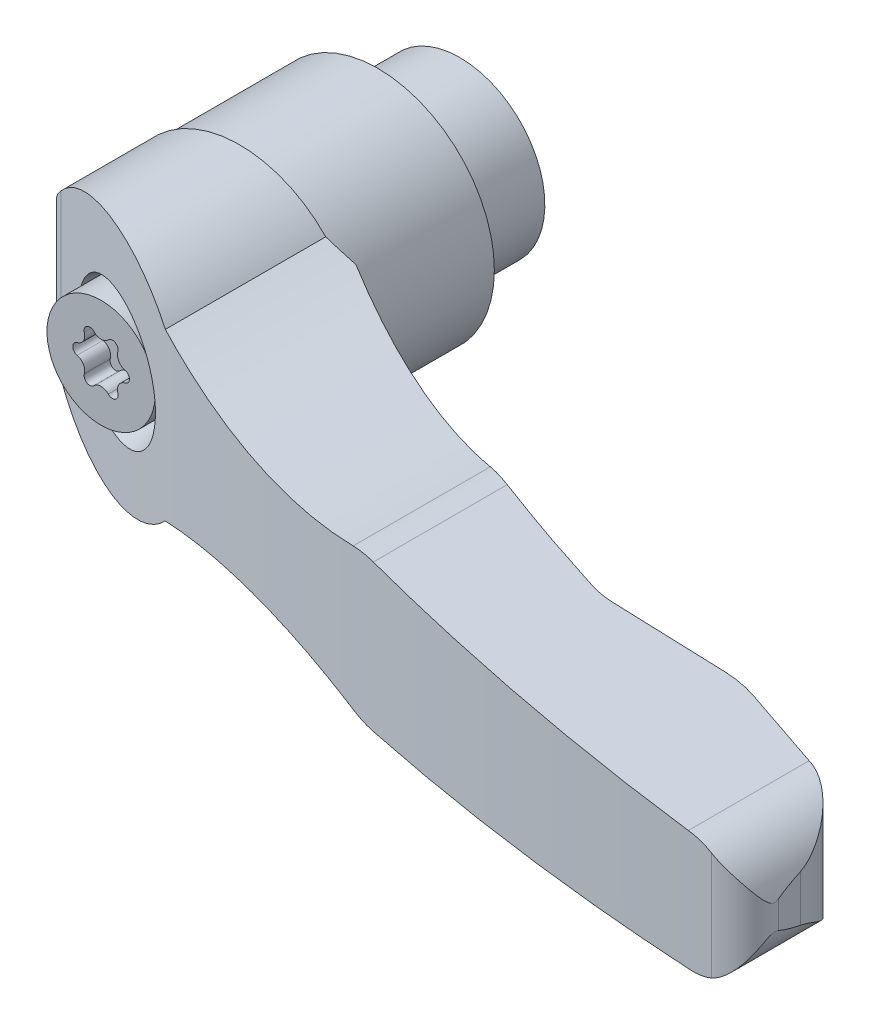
ISO-10303-21;
HEADER;
FILE_DESCRIPTION(('STEP AP214'),'2;1');
FILE_NAME('part.step','',(''),(''),'','','');
FILE_SCHEMA(('AUTOMOTIVE_DESIGN { 1 0 10303 214 1 1 1 1 }'));
ENDSEC;
DATA;
#1=APPLICATION_CONTEXT('core data for automotive mechanical design processes');
#2=APPLICATION_PROTOCOL_DEFINITION('international standard','automotive_design',2000,#1);
#3=PRODUCT_CONTEXT('',#1,'mechanical');
#4=PRODUCT('Part','Part','',(#3));
#5=PRODUCT_RELATED_PRODUCT_CATEGORY('part','',(#4));
#6=PRODUCT_DEFINITION_FORMATION('','',#4);
#7=PRODUCT_DEFINITION_CONTEXT('part definition',#1,'design');
#8=PRODUCT_DEFINITION('design','',#6,#7);
#9=PRODUCT_DEFINITION_SHAPE('','',#8);
#10=(LENGTH_UNIT() NAMED_UNIT(*) SI_UNIT(.MILLI.,.METRE.));
#11=(NAMED_UNIT(*) PLANE_ANGLE_UNIT() SI_UNIT($,.RADIAN.));
#12=(NAMED_UNIT(*) SI_UNIT($,.STERADIAN.) SOLID_ANGLE_UNIT());
#13=UNCERTAINTY_MEASURE_WITH_UNIT(LENGTH_MEASURE(1.E-05),#10,'distance_accuracy_value','');
#14=(GEOMETRIC_REPRESENTATION_CONTEXT(3) GLOBAL_UNCERTAINTY_ASSIGNED_CONTEXT((#13)) GLOBAL_UNIT_ASSIGNED_CONTEXT((#10,
#11,#12)) REPRESENTATION_CONTEXT('',''));
#15=CARTESIAN_POINT('',(0.,0.,0.));
#16=DIRECTION('',(0.,0.,1.));
#17=DIRECTION('',(1.,0.,0.));
#18=AXIS2_PLACEMENT_3D('',#15,#16,#17);
#19=CARTESIAN_POINT('',(0.9,1.55884572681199,30.56));
#20=DIRECTION('',(0.,0.,1.));
#21=DIRECTION('',(0.,-1.,0.));
#22=AXIS2_PLACEMENT_3D('',#19,#20,#21);
#23=CYLINDRICAL_SURFACE('',#22,0.45);
#24=DIRECTION('',(0.,0.,1.));
#25=VECTOR('',#24,1.);
#26=CARTESIAN_POINT('',(0.572727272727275,1.86770259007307,30.56));
#27=LINE('',#26,#25);
#28=CARTESIAN_POINT('',(0.572727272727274,1.86770259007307,26.44));
#29=VERTEX_POINT('',#28);
#30=CARTESIAN_POINT('',(0.572727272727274,1.86770259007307,28.5));
#31=VERTEX_POINT('',#30);
#32=EDGE_CURVE('E240',#29,#31,#27,.T.);
#33=ORIENTED_EDGE('',*,*,#32,.F.);
#34=CARTESIAN_POINT('',(0.9,1.55884572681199,26.44));
#35=DIRECTION('',(0.,0.,1.));
#36=DIRECTION('',(0.,-1.,0.));
#37=AXIS2_PLACEMENT_3D('',#34,#35,#36);
#38=CIRCLE('',#37,0.45);
#39=CARTESIAN_POINT('',(1.33111425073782,1.42984765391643,26.44));
#40=VERTEX_POINT('',#39);
#41=EDGE_CURVE('E233',#40,#29,#38,.T.);
#42=ORIENTED_EDGE('',*,*,#41,.F.);
#43=DIRECTION('',(0.,0.,1.));
#44=VECTOR('',#43,1.);
#45=CARTESIAN_POINT('',(1.33111424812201,1.42984764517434,30.56));
#46=LINE('',#45,#44);
#47=CARTESIAN_POINT('',(1.33111425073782,1.42984765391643,28.5));
#48=VERTEX_POINT('',#47);
#49=EDGE_CURVE('E237',#48,#40,#46,.F.);
#50=ORIENTED_EDGE('',*,*,#49,.F.);
#51=CARTESIAN_POINT('',(0.9,1.55884572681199,28.5));
#52=DIRECTION('',(0.,0.,1.));
#53=DIRECTION('',(0.,-1.,0.));
#54=AXIS2_PLACEMENT_3D('',#51,#52,#53);
#55=CIRCLE('',#54,0.45);
#56=EDGE_CURVE('E243',#31,#48,#55,.F.);
#57=ORIENTED_EDGE('',*,*,#56,.F.);
#58=EDGE_LOOP('',(#33,#42,#50,#57));
#59=FACE_BOUND('',#58,.T.);
#60=ADVANCED_FACE('F14',(#59),#23,.F.);
#61=CARTESIAN_POINT('',(0.,2.40820210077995,30.56));
#62=DIRECTION('',(0.,0.,1.));
#63=DIRECTION('',(0.,-1.,0.));
#64=AXIS2_PLACEMENT_3D('',#61,#62,#63);
#65=CYLINDRICAL_SURFACE('',#64,0.7875);
#66=CARTESIAN_POINT('',(0.,2.40820210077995,26.44));
#67=DIRECTION('',(0.,0.,1.));
#68=DIRECTION('',(0.,-1.,0.));
#69=AXIS2_PLACEMENT_3D('',#66,#67,#68);
#70=CIRCLE('',#69,0.7875);
#71=CARTESIAN_POINT('',(-0.572727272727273,1.86770259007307,26.44));
#72=VERTEX_POINT('',#71);
#73=EDGE_CURVE('E264',#72,#29,#70,.T.);
#74=ORIENTED_EDGE('',*,*,#73,.T.);
#75=ORIENTED_EDGE('',*,*,#32,.T.);
#76=CARTESIAN_POINT('',(0.,2.40820210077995,28.5));
#77=DIRECTION('',(0.,0.,1.));
#78=DIRECTION('',(0.,-1.,0.));
#79=AXIS2_PLACEMENT_3D('',#76,#77,#78);
#80=CIRCLE('',#79,0.7875);
#81=CARTESIAN_POINT('',(-0.572727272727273,1.86770259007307,28.5));
#82=VERTEX_POINT('',#81);
#83=EDGE_CURVE('E593',#31,#82,#80,.F.);
#84=ORIENTED_EDGE('',*,*,#83,.T.);
#85=DIRECTION('',(0.,0.,1.));
#86=VECTOR('',#85,1.);
#87=CARTESIAN_POINT('',(-0.572727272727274,1.86770259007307,30.56));
#88=LINE('',#87,#86);
#89=EDGE_CURVE('E254',#82,#72,#88,.F.);
#90=ORIENTED_EDGE('',*,*,#89,.T.);
#91=EDGE_LOOP('',(#74,#75,#84,#90));
#92=FACE_BOUND('',#91,.T.);
#93=ADVANCED_FACE('F778',(#92),#65,.T.);
#94=CARTESIAN_POINT('',(2.08556419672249,1.20410105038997,30.56));
#95=DIRECTION('',(0.,0.,1.));
#96=DIRECTION('',(0.,-1.,0.));
#97=AXIS2_PLACEMENT_3D('',#94,#95,#96);
#98=CYLINDRICAL_SURFACE('',#97,0.7875);
#99=CARTESIAN_POINT('',(2.08556419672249,1.20410105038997,26.44));
#100=DIRECTION('',(0.,0.,1.));
#101=DIRECTION('',(0.,-1.,0.));
#102=AXIS2_PLACEMENT_3D('',#99,#100,#101);
#103=CIRCLE('',#102,0.7875);
#104=CARTESIAN_POINT('',(1.90384152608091,0.437854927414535,26.44));
#105=VERTEX_POINT('',#104);
#106=EDGE_CURVE('E247',#40,#105,#103,.T.);
#107=ORIENTED_EDGE('',*,*,#106,.T.);
#108=DIRECTION('',(0.,0.,1.));
#109=VECTOR('',#108,1.);
#110=CARTESIAN_POINT('',(1.90384152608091,0.437854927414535,30.56));
#111=LINE('',#110,#109);
#112=CARTESIAN_POINT('',(1.90384152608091,0.437854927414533,28.5));
#113=VERTEX_POINT('',#112);
#114=EDGE_CURVE('E579',#105,#113,#111,.T.);
#115=ORIENTED_EDGE('',*,*,#114,.T.);
#116=CARTESIAN_POINT('',(2.08556419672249,1.20410105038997,28.5));
#117=DIRECTION('',(0.,0.,1.));
#118=DIRECTION('',(0.,-1.,0.));
#119=AXIS2_PLACEMENT_3D('',#116,#117,#118);
#120=CIRCLE('',#119,0.7875);
#121=EDGE_CURVE('E257',#113,#48,#120,.F.);
#122=ORIENTED_EDGE('',*,*,#121,.T.);
#123=ORIENTED_EDGE('',*,*,#49,.T.);
#124=EDGE_LOOP('',(#107,#115,#122,#123));
#125=FACE_BOUND('',#124,.T.);
#126=ADVANCED_FACE('F256',(#125),#98,.T.);
#127=CARTESIAN_POINT('',(-0.9,1.55884572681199,30.56));
#128=DIRECTION('',(0.,0.,1.));
#129=DIRECTION('',(0.,-1.,0.));
#130=AXIS2_PLACEMENT_3D('',#127,#128,#129);
#131=CYLINDRICAL_SURFACE('',#130,0.45);
#132=DIRECTION('',(0.,0.,1.));
#133=VECTOR('',#132,1.);
#134=CARTESIAN_POINT('',(-1.33111425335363,1.42984766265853,30.56));
#135=LINE('',#134,#133);
#136=CARTESIAN_POINT('',(-1.33111425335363,1.42984766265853,26.44));
#137=VERTEX_POINT('',#136);
#138=CARTESIAN_POINT('',(-1.33111425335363,1.42984766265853,28.5));
#139=VERTEX_POINT('',#138);
#140=EDGE_CURVE('E576',#137,#139,#135,.T.);
#141=ORIENTED_EDGE('',*,*,#140,.F.);
#142=CARTESIAN_POINT('',(-0.9,1.55884572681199,26.44));
#143=DIRECTION('',(0.,0.,1.));
#144=DIRECTION('',(0.,-1.,0.));
#145=AXIS2_PLACEMENT_3D('',#142,#143,#144);
#146=CIRCLE('',#145,0.45);
#147=EDGE_CURVE('E587',#72,#137,#146,.T.);
#148=ORIENTED_EDGE('',*,*,#147,.F.);
#149=ORIENTED_EDGE('',*,*,#89,.F.);
#150=CARTESIAN_POINT('',(-0.9,1.55884572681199,28.5));
#151=DIRECTION('',(0.,0.,1.));
#152=DIRECTION('',(0.,-1.,0.));
#153=AXIS2_PLACEMENT_3D('',#150,#151,#152);
#154=CIRCLE('',#153,0.45);
#155=EDGE_CURVE('E584',#139,#82,#154,.F.);
#156=ORIENTED_EDGE('',*,*,#155,.F.);
#157=EDGE_LOOP('',(#141,#148,#149,#156));
#158=FACE_BOUND('',#157,.T.);
#159=ADVANCED_FACE('F776',(#158),#131,.F.);
#160=CARTESIAN_POINT('',(1.8,0.,30.56));
#161=DIRECTION('',(0.,0.,1.));
#162=DIRECTION('',(0.,-1.,0.));
#163=AXIS2_PLACEMENT_3D('',#160,#161,#162);
#164=CYLINDRICAL_SURFACE('',#163,0.45);
#165=ORIENTED_EDGE('',*,*,#114,.F.);
#166=CARTESIAN_POINT('',(1.8,0.,26.44));
#167=DIRECTION('',(0.,0.,1.));
#168=DIRECTION('',(0.,-1.,0.));
#169=AXIS2_PLACEMENT_3D('',#166,#167,#168);
#170=CIRCLE('',#169,0.45);
#171=CARTESIAN_POINT('',(1.90384152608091,-0.437854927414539,26.44));
#172=VERTEX_POINT('',#171);
#173=EDGE_CURVE('E250',#172,#105,#170,.T.);
#174=ORIENTED_EDGE('',*,*,#173,.F.);
#175=DIRECTION('',(0.,0.,1.));
#176=VECTOR('',#175,1.);
#177=CARTESIAN_POINT('',(1.90384152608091,-0.437854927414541,30.56));
#178=LINE('',#177,#176);
#179=CARTESIAN_POINT('',(1.90384152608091,-0.437854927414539,28.5));
#180=VERTEX_POINT('',#179);
#181=EDGE_CURVE('E571',#180,#172,#178,.F.);
#182=ORIENTED_EDGE('',*,*,#181,.F.);
#183=CARTESIAN_POINT('',(1.8,0.,28.5));
#184=DIRECTION('',(0.,0.,1.));
#185=DIRECTION('',(0.,-1.,0.));
#186=AXIS2_PLACEMENT_3D('',#183,#184,#185);
#187=CIRCLE('',#186,0.45);
#188=EDGE_CURVE('E580',#113,#180,#187,.F.);
#189=ORIENTED_EDGE('',*,*,#188,.F.);
#190=EDGE_LOOP('',(#165,#174,#182,#189));
#191=FACE_BOUND('',#190,.T.);
#192=ADVANCED_FACE('F790',(#191),#164,.F.);
#193=CARTESIAN_POINT('',(5.375,0.,0.));
#194=DIRECTION('',(0.,0.,-1.));
#195=DIRECTION('',(0.,1.,0.));
#196=AXIS2_PLACEMENT_3D('',#193,#194,#195);
#197=PLANE('',#196);
#198=CARTESIAN_POINT('',(0.,0.,0.));
#199=DIRECTION('',(0.,0.,-1.));
#200=DIRECTION('',(-1.,0.,0.));
#201=AXIS2_PLACEMENT_3D('',#198,#199,#200);
#202=CIRCLE('',#201,4.49999999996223);
#203=CARTESIAN_POINT('',(-4.49999999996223,0.,0.));
#204=VERTEX_POINT('',#203);
#205=EDGE_CURVE('E9',#204,#204,#202,.F.);
#206=ORIENTED_EDGE('',*,*,#205,.T.);
#207=EDGE_LOOP('',(#206));
#208=FACE_BOUND('',#207,.T.);
#209=CARTESIAN_POINT('',(0.,0.,0.));
#210=DIRECTION('',(0.,0.,-1.));
#211=DIRECTION('',(0.,1.,0.));
#212=AXIS2_PLACEMENT_3D('',#209,#210,#211);
#213=CIRCLE('',#212,6.75);
#214=CARTESIAN_POINT('',(0.,6.75,0.));
#215=VERTEX_POINT('',#214);
#216=EDGE_CURVE('E570',#215,#215,#213,.F.);
#217=ORIENTED_EDGE('',*,*,#216,.F.);
#218=EDGE_LOOP('',(#217));
#219=FACE_BOUND('',#218,.T.);
#220=ADVANCED_FACE('F793',(#208,#219),#197,.T.);
#221=CARTESIAN_POINT('',(-2.08556419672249,1.20410105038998,30.56));
#222=DIRECTION('',(0.,0.,1.));
#223=DIRECTION('',(0.,-1.,0.));
#224=AXIS2_PLACEMENT_3D('',#221,#222,#223);
#225=CYLINDRICAL_SURFACE('',#224,0.7875);
#226=CARTESIAN_POINT('',(-2.08556419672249,1.20410105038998,26.44));
#227=DIRECTION('',(0.,0.,1.));
#228=DIRECTION('',(0.,-1.,0.));
#229=AXIS2_PLACEMENT_3D('',#226,#227,#228);
#230=CIRCLE('',#229,0.7875);
#231=CARTESIAN_POINT('',(-1.90384151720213,0.437854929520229,26.44));
#232=VERTEX_POINT('',#231);
#233=EDGE_CURVE('E578',#232,#137,#230,.T.);
#234=ORIENTED_EDGE('',*,*,#233,.T.);
#235=ORIENTED_EDGE('',*,*,#140,.T.);
#236=CARTESIAN_POINT('',(-2.08556419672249,1.20410105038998,28.5));
#237=DIRECTION('',(0.,0.,1.));
#238=DIRECTION('',(0.,-1.,0.));
#239=AXIS2_PLACEMENT_3D('',#236,#237,#238);
#240=CIRCLE('',#239,0.7875);
#241=CARTESIAN_POINT('',(-1.90384151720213,0.437854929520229,28.5));
#242=VERTEX_POINT('',#241);
#243=EDGE_CURVE('E582',#139,#242,#240,.F.);
#244=ORIENTED_EDGE('',*,*,#243,.T.);
#245=DIRECTION('',(0.,0.,1.));
#246=VECTOR('',#245,1.);
#247=CARTESIAN_POINT('',(-1.90384150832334,0.437854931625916,30.56));
#248=LINE('',#247,#246);
#249=EDGE_CURVE('E566',#242,#232,#248,.F.);
#250=ORIENTED_EDGE('',*,*,#249,.T.);
#251=EDGE_LOOP('',(#234,#235,#244,#250));
#252=FACE_BOUND('',#251,.T.);
#253=ADVANCED_FACE('F759',(#252),#225,.T.);
#254=CARTESIAN_POINT('',(2.08556419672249,-1.20410105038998,30.56));
#255=DIRECTION('',(0.,0.,1.));
#256=DIRECTION('',(0.,-1.,0.));
#257=AXIS2_PLACEMENT_3D('',#254,#255,#256);
#258=CYLINDRICAL_SURFACE('',#257,0.7875);
#259=CARTESIAN_POINT('',(2.08556419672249,-1.20410105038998,26.44));
#260=DIRECTION('',(0.,0.,1.));
#261=DIRECTION('',(0.,-1.,0.));
#262=AXIS2_PLACEMENT_3D('',#259,#260,#261);
#263=CIRCLE('',#262,0.7875);
#264=CARTESIAN_POINT('',(1.33111425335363,-1.42984766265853,26.44));
#265=VERTEX_POINT('',#264);
#266=EDGE_CURVE('E574',#172,#265,#263,.T.);
#267=ORIENTED_EDGE('',*,*,#266,.T.);
#268=DIRECTION('',(0.,0.,1.));
#269=VECTOR('',#268,1.);
#270=CARTESIAN_POINT('',(1.33111425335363,-1.42984766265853,30.56));
#271=LINE('',#270,#269);
#272=CARTESIAN_POINT('',(1.33111425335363,-1.42984766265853,28.5));
#273=VERTEX_POINT('',#272);
#274=EDGE_CURVE('E553',#265,#273,#271,.T.);
#275=ORIENTED_EDGE('',*,*,#274,.T.);
#276=CARTESIAN_POINT('',(2.08556419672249,-1.20410105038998,28.5));
#277=DIRECTION('',(0.,0.,1.));
#278=DIRECTION('',(0.,-1.,0.));
#279=AXIS2_PLACEMENT_3D('',#276,#277,#278);
#280=CIRCLE('',#279,0.7875);
#281=EDGE_CURVE('E575',#273,#180,#280,.F.);
#282=ORIENTED_EDGE('',*,*,#281,.T.);
#283=ORIENTED_EDGE('',*,*,#181,.T.);
#284=EDGE_LOOP('',(#267,#275,#282,#283));
#285=FACE_BOUND('',#284,.T.);
#286=ADVANCED_FACE('F800',(#285),#258,.T.);
#287=CARTESIAN_POINT('',(0.,0.,8.25));
#288=DIRECTION('',(0.,0.,-1.));
#289=DIRECTION('',(0.,1.,0.));
#290=AXIS2_PLACEMENT_3D('',#287,#288,#289);
#291=CYLINDRICAL_SURFACE('',#290,6.75);
#292=ORIENTED_EDGE('',*,*,#216,.T.);
#293=EDGE_LOOP('',(#292));
#294=FACE_BOUND('',#293,.T.);
#295=CARTESIAN_POINT('',(0.,0.,7.15000000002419));
#296=DIRECTION('',(0.,0.,-1.));
#297=DIRECTION('',(1.,0.,0.));
#298=AXIS2_PLACEMENT_3D('',#295,#296,#297);
#299=CIRCLE('',#298,6.74999999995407);
#300=CARTESIAN_POINT('',(6.74999999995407,0.,7.15000000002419));
#301=VERTEX_POINT('',#300);
#302=EDGE_CURVE('E563',#301,#301,#299,.T.);
#303=ORIENTED_EDGE('',*,*,#302,.T.);
#304=EDGE_LOOP('',(#303));
#305=FACE_BOUND('',#304,.T.);
#306=ADVANCED_FACE('F803',(#294,#305),#291,.T.);
#307=CARTESIAN_POINT('',(-1.8,0.,30.56));
#308=DIRECTION('',(0.,0.,1.));
#309=DIRECTION('',(0.,-1.,0.));
#310=AXIS2_PLACEMENT_3D('',#307,#308,#309);
#311=CYLINDRICAL_SURFACE('',#310,0.45);
#312=DIRECTION('',(0.,0.,1.));
#313=VECTOR('',#312,1.);
#314=CARTESIAN_POINT('',(-1.90384152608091,-0.437854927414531,30.56));
#315=LINE('',#314,#313);
#316=CARTESIAN_POINT('',(-1.90384152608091,-0.437854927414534,26.44));
#317=VERTEX_POINT('',#316);
#318=CARTESIAN_POINT('',(-1.9038415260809,-0.437854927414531,28.5));
#319=VERTEX_POINT('',#318);
#320=EDGE_CURVE('E558',#317,#319,#315,.T.);
#321=ORIENTED_EDGE('',*,*,#320,.F.);
#322=CARTESIAN_POINT('',(-1.8,0.,26.44));
#323=DIRECTION('',(0.,0.,1.));
#324=DIRECTION('',(0.,-1.,0.));
#325=AXIS2_PLACEMENT_3D('',#322,#323,#324);
#326=CIRCLE('',#325,0.45);
#327=EDGE_CURVE('E569',#232,#317,#326,.T.);
#328=ORIENTED_EDGE('',*,*,#327,.F.);
#329=ORIENTED_EDGE('',*,*,#249,.F.);
#330=CARTESIAN_POINT('',(-1.8,0.,28.5));
#331=DIRECTION('',(0.,0.,1.));
#332=DIRECTION('',(0.,-1.,0.));
#333=AXIS2_PLACEMENT_3D('',#330,#331,#332);
#334=CIRCLE('',#333,0.45);
#335=EDGE_CURVE('E557',#319,#242,#334,.F.);
#336=ORIENTED_EDGE('',*,*,#335,.F.);
#337=EDGE_LOOP('',(#321,#328,#329,#336));
#338=FACE_BOUND('',#337,.T.);
#339=ADVANCED_FACE('F769',(#338),#311,.F.);
#340=CARTESIAN_POINT('',(0.9,-1.55884572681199,30.56));
#341=DIRECTION('',(0.,0.,1.));
#342=DIRECTION('',(0.,-1.,0.));
#343=AXIS2_PLACEMENT_3D('',#340,#341,#342);
#344=CYLINDRICAL_SURFACE('',#343,0.45);
#345=ORIENTED_EDGE('',*,*,#274,.F.);
#346=CARTESIAN_POINT('',(0.9,-1.55884572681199,26.44));
#347=DIRECTION('',(0.,0.,1.));
#348=DIRECTION('',(0.,-1.,0.));
#349=AXIS2_PLACEMENT_3D('',#346,#347,#348);
#350=CIRCLE('',#349,0.45);
#351=CARTESIAN_POINT('',(0.572727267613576,-1.86770258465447,26.44));
#352=VERTEX_POINT('',#351);
#353=EDGE_CURVE('E742',#352,#265,#350,.T.);
#354=ORIENTED_EDGE('',*,*,#353,.F.);
#355=DIRECTION('',(0.,0.,1.));
#356=VECTOR('',#355,1.);
#357=CARTESIAN_POINT('',(0.572727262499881,-1.86770257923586,30.56));
#358=LINE('',#357,#356);
#359=CARTESIAN_POINT('',(0.572727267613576,-1.86770258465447,28.5));
#360=VERTEX_POINT('',#359);
#361=EDGE_CURVE('E549',#360,#352,#358,.F.);
#362=ORIENTED_EDGE('',*,*,#361,.F.);
#363=CARTESIAN_POINT('',(0.9,-1.55884572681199,28.5));
#364=DIRECTION('',(0.,0.,1.));
#365=DIRECTION('',(0.,-1.,0.));
#366=AXIS2_PLACEMENT_3D('',#363,#364,#365);
#367=CIRCLE('',#366,0.45);
#368=EDGE_CURVE('E556',#273,#360,#367,.F.);
#369=ORIENTED_EDGE('',*,*,#368,.F.);
#370=EDGE_LOOP('',(#345,#354,#362,#369));
#371=FACE_BOUND('',#370,.T.);
#372=ADVANCED_FACE('F810',(#371),#344,.F.);
#373=CARTESIAN_POINT('',(0.,0.,6.9000000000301));
#374=DIRECTION('',(0.,0.,-1.));
#375=DIRECTION('',(0.,1.,0.));
#376=AXIS2_PLACEMENT_3D('',#373,#374,#375);
#377=CONICAL_SURFACE('',#376,7.000000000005,0.785398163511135);
#378=ORIENTED_EDGE('',*,*,#302,.F.);
#379=EDGE_LOOP('',(#378));
#380=FACE_BOUND('',#379,.T.);
#381=CARTESIAN_POINT('',(0.,0.,6.9));
#382=DIRECTION('',(0.,0.,-1.));
#383=DIRECTION('',(0.,1.,0.));
#384=AXIS2_PLACEMENT_3D('',#381,#382,#383);
#385=CIRCLE('',#384,7.);
#386=CARTESIAN_POINT('',(0.,7.,6.9));
#387=VERTEX_POINT('',#386);
#388=EDGE_CURVE('E545',#387,#387,#385,.T.);
#389=ORIENTED_EDGE('',*,*,#388,.T.);
#390=EDGE_LOOP('',(#389));
#391=FACE_BOUND('',#390,.T.);
#392=ADVANCED_FACE('F813',(#380,#391),#377,.F.);
#393=CARTESIAN_POINT('',(-2.08556419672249,-1.20410105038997,30.56));
#394=DIRECTION('',(0.,0.,1.));
#395=DIRECTION('',(0.,-1.,0.));
#396=AXIS2_PLACEMENT_3D('',#393,#394,#395);
#397=CYLINDRICAL_SURFACE('',#396,0.7875);
#398=CARTESIAN_POINT('',(-2.08556419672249,-1.20410105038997,26.44));
#399=DIRECTION('',(0.,0.,1.));
#400=DIRECTION('',(0.,-1.,0.));
#401=AXIS2_PLACEMENT_3D('',#398,#399,#400);
#402=CIRCLE('',#401,0.7875);
#403=CARTESIAN_POINT('',(-1.33111425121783,-1.42984765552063,26.44));
#404=VERTEX_POINT('',#403);
#405=EDGE_CURVE('E561',#317,#404,#402,.F.);
#406=ORIENTED_EDGE('',*,*,#405,.F.);
#407=ORIENTED_EDGE('',*,*,#320,.T.);
#408=CARTESIAN_POINT('',(-2.08556419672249,-1.20410105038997,28.5));
#409=DIRECTION('',(0.,0.,1.));
#410=DIRECTION('',(0.,-1.,0.));
#411=AXIS2_PLACEMENT_3D('',#408,#409,#410);
#412=CIRCLE('',#411,0.7875);
#413=CARTESIAN_POINT('',(-1.33111425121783,-1.42984765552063,28.5));
#414=VERTEX_POINT('',#413);
#415=EDGE_CURVE('E562',#319,#414,#412,.F.);
#416=ORIENTED_EDGE('',*,*,#415,.T.);
#417=DIRECTION('',(0.,0.,1.));
#418=VECTOR('',#417,1.);
#419=CARTESIAN_POINT('',(-1.33111424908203,-1.42984764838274,30.56));
#420=LINE('',#419,#418);
#421=EDGE_CURVE('E543',#414,#404,#420,.F.);
#422=ORIENTED_EDGE('',*,*,#421,.T.);
#423=EDGE_LOOP('',(#406,#407,#416,#422));
#424=FACE_BOUND('',#423,.T.);
#425=ADVANCED_FACE('F817',(#424),#397,.T.);
#426=CARTESIAN_POINT('',(0.,0.,26.44));
#427=DIRECTION('',(0.,0.,1.));
#428=DIRECTION('',(0.,-1.,0.));
#429=AXIS2_PLACEMENT_3D('',#426,#427,#428);
#430=PLANE('',#429);
#431=ORIENTED_EDGE('',*,*,#233,.F.);
#432=ORIENTED_EDGE('',*,*,#327,.T.);
#433=ORIENTED_EDGE('',*,*,#405,.T.);
#434=CARTESIAN_POINT('',(-0.9,-1.55884572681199,26.44));
#435=DIRECTION('',(0.,0.,1.));
#436=DIRECTION('',(0.,-1.,0.));
#437=AXIS2_PLACEMENT_3D('',#434,#435,#436);
#438=CIRCLE('',#437,0.45);
#439=CARTESIAN_POINT('',(-0.572727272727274,-1.86770259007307,26.44));
#440=VERTEX_POINT('',#439);
#441=EDGE_CURVE('E542',#404,#440,#438,.T.);
#442=ORIENTED_EDGE('',*,*,#441,.T.);
#443=CARTESIAN_POINT('',(0.,-2.40820210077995,26.44));
#444=DIRECTION('',(0.,0.,1.));
#445=DIRECTION('',(0.,-1.,0.));
#446=AXIS2_PLACEMENT_3D('',#443,#444,#445);
#447=CIRCLE('',#446,0.7875);
#448=EDGE_CURVE('E548',#352,#440,#447,.T.);
#449=ORIENTED_EDGE('',*,*,#448,.F.);
#450=ORIENTED_EDGE('',*,*,#353,.T.);
#451=ORIENTED_EDGE('',*,*,#266,.F.);
#452=ORIENTED_EDGE('',*,*,#173,.T.);
#453=ORIENTED_EDGE('',*,*,#106,.F.);
#454=ORIENTED_EDGE('',*,*,#41,.T.);
#455=ORIENTED_EDGE('',*,*,#73,.F.);
#456=ORIENTED_EDGE('',*,*,#147,.T.);
#457=EDGE_LOOP('',(#431,#432,#433,#442,#449,#450,#451,#452,#453,#454,#455,#456));
#458=FACE_BOUND('',#457,.T.);
#459=ADVANCED_FACE('F248',(#458),#430,.T.);
#460=CARTESIAN_POINT('',(0.,-2.40820210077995,30.56));
#461=DIRECTION('',(0.,0.,1.));
#462=DIRECTION('',(0.,-1.,0.));
#463=AXIS2_PLACEMENT_3D('',#460,#461,#462);
#464=CYLINDRICAL_SURFACE('',#463,0.7875);
#465=ORIENTED_EDGE('',*,*,#448,.T.);
#466=DIRECTION('',(0.,0.,1.));
#467=VECTOR('',#466,1.);
#468=CARTESIAN_POINT('',(-0.572727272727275,-1.86770259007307,30.56));
#469=LINE('',#468,#467);
#470=CARTESIAN_POINT('',(-0.572727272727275,-1.86770259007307,28.5));
#471=VERTEX_POINT('',#470);
#472=EDGE_CURVE('E538',#440,#471,#469,.T.);
#473=ORIENTED_EDGE('',*,*,#472,.T.);
#474=CARTESIAN_POINT('',(0.,-2.40820210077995,28.5));
#475=DIRECTION('',(0.,0.,1.));
#476=DIRECTION('',(0.,-1.,0.));
#477=AXIS2_PLACEMENT_3D('',#474,#475,#476);
#478=CIRCLE('',#477,0.7875);
#479=EDGE_CURVE('E552',#471,#360,#478,.F.);
#480=ORIENTED_EDGE('',*,*,#479,.T.);
#481=ORIENTED_EDGE('',*,*,#361,.T.);
#482=EDGE_LOOP('',(#465,#473,#480,#481));
#483=FACE_BOUND('',#482,.T.);
#484=ADVANCED_FACE('F824',(#483),#464,.T.);
#485=CARTESIAN_POINT('',(0.,0.,6.2));
#486=DIRECTION('',(0.,0.,-1.));
#487=DIRECTION('',(0.,1.,0.));
#488=AXIS2_PLACEMENT_3D('',#485,#486,#487);
#489=CYLINDRICAL_SURFACE('',#488,7.);
#490=ORIENTED_EDGE('',*,*,#388,.F.);
#491=EDGE_LOOP('',(#490));
#492=FACE_BOUND('',#491,.T.);
#493=CARTESIAN_POINT('',(0.,0.,6.5));
#494=DIRECTION('',(0.,0.,-1.));
#495=DIRECTION('',(0.,1.,0.));
#496=AXIS2_PLACEMENT_3D('',#493,#494,#495);
#497=CIRCLE('',#496,7.);
#498=CARTESIAN_POINT('',(0.,7.,6.5));
#499=VERTEX_POINT('',#498);
#500=EDGE_CURVE('E541',#499,#499,#497,.F.);
#501=ORIENTED_EDGE('',*,*,#500,.F.);
#502=EDGE_LOOP('',(#501));
#503=FACE_BOUND('',#502,.T.);
#504=ADVANCED_FACE('F827',(#492,#503),#489,.F.);
#505=CARTESIAN_POINT('',(-0.9,-1.55884572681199,30.56));
#506=DIRECTION('',(0.,0.,1.));
#507=DIRECTION('',(0.,-1.,0.));
#508=AXIS2_PLACEMENT_3D('',#505,#506,#507);
#509=CYLINDRICAL_SURFACE('',#508,0.45);
#510=ORIENTED_EDGE('',*,*,#472,.F.);
#511=ORIENTED_EDGE('',*,*,#441,.F.);
#512=ORIENTED_EDGE('',*,*,#421,.F.);
#513=CARTESIAN_POINT('',(-0.9,-1.55884572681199,28.5));
#514=DIRECTION('',(0.,0.,1.));
#515=DIRECTION('',(0.,-1.,0.));
#516=AXIS2_PLACEMENT_3D('',#513,#514,#515);
#517=CIRCLE('',#516,0.45);
#518=EDGE_CURVE('E731',#471,#414,#517,.F.);
#519=ORIENTED_EDGE('',*,*,#518,.F.);
#520=EDGE_LOOP('',(#510,#511,#512,#519));
#521=FACE_BOUND('',#520,.T.);
#522=ADVANCED_FACE('F831',(#521),#509,.F.);
#523=CARTESIAN_POINT('',(-9.01003775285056,-19.,6.5));
#524=DIRECTION('',(0.707106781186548,0.,0.707106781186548));
#525=DIRECTION('',(-0.707106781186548,0.,0.707106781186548));
#526=AXIS2_PLACEMENT_3D('',#523,#524,#525);
#527=PLANE('',#526);
#528=DIRECTION('',(0.,1.,0.));
#529=VECTOR('',#528,1.);
#530=CARTESIAN_POINT('',(-9.01003775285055,0.,6.5));
#531=LINE('',#530,#529);
#532=CARTESIAN_POINT('',(-9.01003775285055,-2.13584185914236,6.5));
#533=VERTEX_POINT('',#532);
#534=CARTESIAN_POINT('',(-9.01003775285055,2.13584185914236,6.5));
#535=VERTEX_POINT('',#534);
#536=EDGE_CURVE('E734',#533,#535,#531,.T.);
#537=ORIENTED_EDGE('',*,*,#536,.F.);
#538=CARTESIAN_POINT('',(-0.00999999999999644,0.,-2.50003775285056));
#539=DIRECTION('',(0.707106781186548,0.,0.707106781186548));
#540=DIRECTION('',(-0.707106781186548,0.,0.707106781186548));
#541=AXIS2_PLACEMENT_3D('',#538,#539,#540);
#542=ELLIPSE('',#541,13.0814754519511,9.25);
#543=EDGE_CURVE('E728',#535,#533,#542,.T.);
#544=ORIENTED_EDGE('',*,*,#543,.F.);
#545=EDGE_LOOP('',(#537,#544));
#546=FACE_BOUND('',#545,.T.);
#547=ADVANCED_FACE('F835',(#546),#527,.F.);
#548=CARTESIAN_POINT('',(-4.635,0.,6.5));
#549=DIRECTION('',(0.,0.,-1.));
#550=DIRECTION('',(0.,1.,0.));
#551=AXIS2_PLACEMENT_3D('',#548,#549,#550);
#552=PLANE('',#551);
#553=ORIENTED_EDGE('',*,*,#536,.T.);
#554=CARTESIAN_POINT('',(-0.00999999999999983,0.,6.5));
#555=DIRECTION('',(0.,0.,1.));
#556=DIRECTION('',(-1.,0.,0.));
#557=AXIS2_PLACEMENT_3D('',#554,#555,#556);
#558=CIRCLE('',#557,9.25);
#559=EDGE_CURVE('E725',#533,#535,#558,.T.);
#560=ORIENTED_EDGE('',*,*,#559,.F.);
#561=EDGE_LOOP('',(#553,#560));
#562=FACE_BOUND('',#561,.T.);
#563=ORIENTED_EDGE('',*,*,#500,.T.);
#564=EDGE_LOOP('',(#563));
#565=FACE_BOUND('',#564,.T.);
#566=ADVANCED_FACE('F839',(#562,#565),#552,.T.);
#567=CARTESIAN_POINT('',(2.15,0.,28.5));
#568=DIRECTION('',(0.,0.,1.));
#569=DIRECTION('',(0.,-1.,0.));
#570=AXIS2_PLACEMENT_3D('',#567,#568,#569);
#571=PLANE('',#570);
#572=CARTESIAN_POINT('',(0.,0.,28.5));
#573=DIRECTION('',(0.,0.,-1.));
#574=DIRECTION('',(0.,1.,0.));
#575=AXIS2_PLACEMENT_3D('',#572,#573,#574);
#576=CIRCLE('',#575,4.3);
#577=CARTESIAN_POINT('',(0.,4.3,28.5));
#578=VERTEX_POINT('',#577);
#579=EDGE_CURVE('E721',#578,#578,#576,.T.);
#580=ORIENTED_EDGE('',*,*,#579,.F.);
#581=EDGE_LOOP('',(#580));
#582=FACE_BOUND('',#581,.T.);
#583=ORIENTED_EDGE('',*,*,#479,.F.);
#584=ORIENTED_EDGE('',*,*,#518,.T.);
#585=ORIENTED_EDGE('',*,*,#415,.F.);
#586=ORIENTED_EDGE('',*,*,#335,.T.);
#587=ORIENTED_EDGE('',*,*,#243,.F.);
#588=ORIENTED_EDGE('',*,*,#155,.T.);
#589=ORIENTED_EDGE('',*,*,#83,.F.);
#590=ORIENTED_EDGE('',*,*,#56,.T.);
#591=ORIENTED_EDGE('',*,*,#121,.F.);
#592=ORIENTED_EDGE('',*,*,#188,.T.);
#593=ORIENTED_EDGE('',*,*,#281,.F.);
#594=ORIENTED_EDGE('',*,*,#368,.T.);
#595=EDGE_LOOP('',(#583,#584,#585,#586,#587,#588,#589,#590,#591,#592,#593,#594));
#596=FACE_BOUND('',#595,.T.);
#597=ADVANCED_FACE('F766',(#582,#596),#571,.T.);
#598=CARTESIAN_POINT('',(-0.0100000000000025,0.,13.5625));
#599=DIRECTION('',(0.,0.,1.));
#600=DIRECTION('',(-1.,0.,0.));
#601=AXIS2_PLACEMENT_3D('',#598,#599,#600);
#602=CYLINDRICAL_SURFACE('',#601,9.25);
#603=ORIENTED_EDGE('',*,*,#559,.T.);
#604=ORIENTED_EDGE('',*,*,#543,.T.);
#605=EDGE_LOOP('',(#603,#604));
#606=FACE_BOUND('',#605,.T.);
#607=CARTESIAN_POINT('',(-0.010000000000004,0.,17.5));
#608=DIRECTION('',(0.,0.,1.));
#609=DIRECTION('',(-1.,0.,0.));
#610=AXIS2_PLACEMENT_3D('',#607,#608,#609);
#611=CIRCLE('',#610,9.25);
#612=CARTESIAN_POINT('',(-9.26,0.,17.5));
#613=VERTEX_POINT('',#612);
#614=CARTESIAN_POINT('',(9.23999999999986,0.,17.5000000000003));
#615=VERTEX_POINT('',#614);
#616=EDGE_CURVE('E711',#613,#615,#611,.T.);
#617=ORIENTED_EDGE('',*,*,#616,.F.);
#618=CARTESIAN_POINT('',(-0.010000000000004,0.,17.5));
#619=DIRECTION('',(0.,0.,1.));
#620=DIRECTION('',(-1.,0.,0.));
#621=AXIS2_PLACEMENT_3D('',#618,#619,#620);
#622=CIRCLE('',#621,9.25);
#623=EDGE_CURVE('E533',#615,#613,#622,.T.);
#624=ORIENTED_EDGE('',*,*,#623,.F.);
#625=EDGE_LOOP('',(#617,#624));
#626=FACE_BOUND('',#625,.T.);
#627=ADVANCED_FACE('F718',(#606,#626),#602,.T.);
#628=CARTESIAN_POINT('',(0.,0.,26.6995));
#629=DIRECTION('',(0.,0.,-1.));
#630=DIRECTION('',(0.,1.,0.));
#631=AXIS2_PLACEMENT_3D('',#628,#629,#630);
#632=CYLINDRICAL_SURFACE('',#631,4.3);
#633=ORIENTED_EDGE('',*,*,#579,.T.);
#634=EDGE_LOOP('',(#633));
#635=FACE_BOUND('',#634,.T.);
#636=CARTESIAN_POINT('',(0.,0.,24.9000000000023));
#637=DIRECTION('',(0.,0.,1.));
#638=DIRECTION('',(1.,0.,0.));
#639=AXIS2_PLACEMENT_3D('',#636,#637,#638);
#640=CIRCLE('',#639,4.30000000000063);
#641=CARTESIAN_POINT('',(4.30000000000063,0.,24.9000000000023));
#642=VERTEX_POINT('',#641);
#643=EDGE_CURVE('E534',#642,#642,#640,.T.);
#644=ORIENTED_EDGE('',*,*,#643,.T.);
#645=EDGE_LOOP('',(#644));
#646=FACE_BOUND('',#645,.T.);
#647=ADVANCED_FACE('F848',(#635,#646),#632,.T.);
#648=CARTESIAN_POINT('',(64.6274051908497,-10.5,37.5817950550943));
#649=DIRECTION('',(0.992331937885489,0.,-0.123601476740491));
#650=DIRECTION('',(0.123601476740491,0.,0.992331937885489));
#651=AXIS2_PLACEMENT_3D('',#648,#649,#650);
#652=PLANE('',#651);
#653=CARTESIAN_POINT('',(60.25,0.,2.43788666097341));
#654=DIRECTION('',(0.992331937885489,0.,-0.123601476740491));
#655=DIRECTION('',(0.123601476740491,0.,0.992331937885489));
#656=AXIS2_PLACEMENT_3D('',#653,#654,#655);
#657=ELLIPSE('',#656,38.4299615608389,4.75);
#658=CARTESIAN_POINT('',(64.8745408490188,1.08449155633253,39.5659186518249));
#659=VERTEX_POINT('',#658);
#660=CARTESIAN_POINT('',(64.6274051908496,1.84413226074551,37.5817950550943));
#661=VERTEX_POINT('',#660);
#662=EDGE_CURVE('E423',#659,#661,#657,.F.);
#663=ORIENTED_EDGE('',*,*,#662,.F.);
#664=DIRECTION('',(0.,-1.,0.));
#665=VECTOR('',#664,1.);
#666=CARTESIAN_POINT('',(64.8745408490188,-10.5,39.5659186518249));
#667=LINE('',#666,#665);
#668=CARTESIAN_POINT('',(64.8745408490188,-1.08449155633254,39.5659186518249));
#669=VERTEX_POINT('',#668);
#670=EDGE_CURVE('E462',#669,#659,#667,.F.);
#671=ORIENTED_EDGE('',*,*,#670,.F.);
#672=CARTESIAN_POINT('',(60.25,0.,2.43788666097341));
#673=DIRECTION('',(0.992331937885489,0.,-0.123601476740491));
#674=DIRECTION('',(0.123601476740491,0.,0.992331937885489));
#675=AXIS2_PLACEMENT_3D('',#672,#673,#674);
#676=ELLIPSE('',#675,38.4299615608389,4.75);
#677=CARTESIAN_POINT('',(64.6274051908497,-1.84413226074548,37.5817950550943));
#678=VERTEX_POINT('',#677);
#679=EDGE_CURVE('E446',#678,#669,#676,.F.);
#680=ORIENTED_EDGE('',*,*,#679,.F.);
#681=DIRECTION('',(0.,-1.,0.));
#682=VECTOR('',#681,1.);
#683=CARTESIAN_POINT('',(64.6274051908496,-10.5,37.5817950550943));
#684=LINE('',#683,#682);
#685=EDGE_CURVE('E719',#661,#678,#684,.T.);
#686=ORIENTED_EDGE('',*,*,#685,.F.);
#687=EDGE_LOOP('',(#663,#671,#680,#686));
#688=FACE_BOUND('',#687,.T.);
#689=ADVANCED_FACE('F432',(#688),#652,.T.);
#690=CARTESIAN_POINT('',(58.6337202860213,-10.5,38.3283479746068));
#691=DIRECTION('',(0.,-1.,0.));
#692=DIRECTION('',(1.,0.,0.));
#693=AXIS2_PLACEMENT_3D('',#690,#691,#692);
#694=CYLINDRICAL_SURFACE('',#693,6.04);
#695=CARTESIAN_POINT('',(64.6274051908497,1.84413226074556,37.5817950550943));
#696=CARTESIAN_POINT('',(64.6175868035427,1.86745330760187,37.5030045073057));
#697=CARTESIAN_POINT('',(64.6063375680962,1.89362327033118,37.4253204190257));
#698=CARTESIAN_POINT('',(64.5811702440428,1.95049016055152,37.2721928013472));
#699=CARTESIAN_POINT('',(64.5672561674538,1.98118026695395,37.1967460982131));
#700=CARTESIAN_POINT('',(64.5369883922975,2.04585034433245,37.0482136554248));
#701=CARTESIAN_POINT('',(64.520645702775,2.07981523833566,36.9751189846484));
#702=CARTESIAN_POINT('',(64.4855821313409,2.15032519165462,36.8307396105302));
#703=CARTESIAN_POINT('',(64.4668602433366,2.18687133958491,36.7594556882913));
#704=CARTESIAN_POINT('',(64.4072221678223,2.29938724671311,36.547961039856));
#705=CARTESIAN_POINT('',(64.3628565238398,2.37818379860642,36.410218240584));
#706=CARTESIAN_POINT('',(64.2652007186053,2.53960895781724,36.1400450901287));
#707=CARTESIAN_POINT('',(64.2118976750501,2.6222429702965,36.007622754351));
#708=CARTESIAN_POINT('',(64.077119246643,2.81672317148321,35.7040219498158));
#709=CARTESIAN_POINT('',(63.9921849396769,2.92909268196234,35.5347005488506));
#710=CARTESIAN_POINT('',(63.8063278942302,3.15216626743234,35.2039790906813));
#711=CARTESIAN_POINT('',(63.7054078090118,3.26287061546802,35.0425777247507));
#712=CARTESIAN_POINT('',(63.4870671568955,3.47959027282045,34.7278934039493));
#713=CARTESIAN_POINT('',(63.369645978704,3.58560540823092,34.5746107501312));
#714=CARTESIAN_POINT('',(63.1179209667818,3.78996521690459,34.277236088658));
#715=CARTESIAN_POINT('',(62.9836257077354,3.88831374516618,34.1331394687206));
#716=CARTESIAN_POINT('',(62.6561598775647,4.10136712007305,33.815313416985));
#717=CARTESIAN_POINT('',(62.4571888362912,4.21258905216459,33.6450495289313));
#718=CARTESIAN_POINT('',(62.1378586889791,4.36029911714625,33.4069452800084));
#719=CARTESIAN_POINT('',(62.0281124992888,4.40629516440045,33.3305585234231));
#720=CARTESIAN_POINT('',(61.8018114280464,4.49098569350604,33.1841350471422));
#721=CARTESIAN_POINT('',(61.6852609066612,4.52968478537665,33.1140943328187));
#722=CARTESIAN_POINT('',(61.4786111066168,4.58924867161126,32.9993621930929));
#723=CARTESIAN_POINT('',(61.3900115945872,4.61209493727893,32.9529824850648));
#724=CARTESIAN_POINT('',(61.2097340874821,4.65295056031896,32.8642982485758));
#725=CARTESIAN_POINT('',(61.1180570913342,4.67096147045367,32.82199241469));
#726=CARTESIAN_POINT('',(60.9313596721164,4.70183469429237,32.7415027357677));
#727=CARTESIAN_POINT('',(60.8363219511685,4.71466416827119,32.7033462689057));
#728=CARTESIAN_POINT('',(60.6438287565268,4.73463763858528,32.631712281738));
#729=CARTESIAN_POINT('',(60.5463713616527,4.74177695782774,32.5982386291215));
#730=CARTESIAN_POINT('',(60.4479724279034,4.74587261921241,32.5672639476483));
#731=B_SPLINE_CURVE_WITH_KNOTS('',3,(#695,#696,#697,#698,#699,#700,#701,#702,#703,#704,#705,
#706,#707,#708,#709,#710,#711,#712,#713,#714,#715,#716,#717,#718,#719,#720,#721,#722,#723,#724,
#725,#726,#727,#728,#729,#730),.UNSPECIFIED.,.F.,.F.,(4,2,2,2,2,2,2,2,2,2,2,2,2,2,2,2,2,4),(0.,
0.248076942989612,0.495783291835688,0.742399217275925,0.989119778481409,1.48293160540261,
1.97746142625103,2.63745339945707,3.29733594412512,3.95724294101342,4.61681594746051,
5.46693586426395,5.89075482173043,6.31430511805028,6.62183365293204,6.92926331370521,
7.23861197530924,7.54821464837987),.UNSPECIFIED.);
#732=CARTESIAN_POINT('',(60.4479724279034,4.74587261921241,32.5672639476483));
#733=VERTEX_POINT('',#732);
#734=EDGE_CURVE('E414',#661,#733,#731,.T.);
#735=ORIENTED_EDGE('',*,*,#734,.F.);
#736=ORIENTED_EDGE('',*,*,#685,.T.);
#737=CARTESIAN_POINT('',(60.4479724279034,-4.74587261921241,32.5672639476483));
#738=CARTESIAN_POINT('',(60.5755504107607,-4.74057354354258,32.6074069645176));
#739=CARTESIAN_POINT('',(60.7015088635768,-4.73014540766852,32.6517620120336));
#740=CARTESIAN_POINT('',(60.9490652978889,-4.69992242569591,32.7481786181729));
#741=CARTESIAN_POINT('',(61.0706698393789,-4.6801423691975,32.8002279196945));
#742=CARTESIAN_POINT('',(61.3074659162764,-4.63235500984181,32.9108206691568));
#743=CARTESIAN_POINT('',(61.4227141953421,-4.60444273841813,32.9692844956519));
#744=CARTESIAN_POINT('',(61.6477173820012,-4.54120548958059,33.0925213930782));
#745=CARTESIAN_POINT('',(61.7574696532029,-4.50587699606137,33.1572974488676));
#746=CARTESIAN_POINT('',(61.9940137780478,-4.42040174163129,33.307032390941));
#747=CARTESIAN_POINT('',(62.1193938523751,-4.36870213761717,33.3933358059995));
#748=CARTESIAN_POINT('',(62.3610721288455,-4.25718277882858,33.5732278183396));
#749=CARTESIAN_POINT('',(62.4773638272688,-4.19735729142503,33.6668215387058));
#750=CARTESIAN_POINT('',(62.7012840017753,-4.07066877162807,33.8608437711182));
#751=CARTESIAN_POINT('',(62.8088611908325,-4.0037687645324,33.9613071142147));
#752=CARTESIAN_POINT('',(63.0146476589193,-3.86453813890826,34.1677809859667));
#753=CARTESIAN_POINT('',(63.1128596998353,-3.79220913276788,34.2737898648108));
#754=CARTESIAN_POINT('',(63.3331746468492,-3.61700510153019,34.5290929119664));
#755=CARTESIAN_POINT('',(63.4514763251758,-3.51235864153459,34.6804594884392));
#756=CARTESIAN_POINT('',(63.6718053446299,-3.29808480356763,34.9913387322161));
#757=CARTESIAN_POINT('',(63.7738256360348,-3.18845529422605,35.1508548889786));
#758=CARTESIAN_POINT('',(63.961662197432,-2.9676568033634,35.4770445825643));
#759=CARTESIAN_POINT('',(64.0475378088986,-2.85649513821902,35.6436890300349));
#760=CARTESIAN_POINT('',(64.2038484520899,-2.63586419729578,35.9851508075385));
#761=CARTESIAN_POINT('',(64.2742871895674,-2.52639452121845,36.1599661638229));
#762=CARTESIAN_POINT('',(64.3705847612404,-2.36382517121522,36.4361542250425));
#763=CARTESIAN_POINT('',(64.4019853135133,-2.30809068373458,36.5340606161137));
#764=CARTESIAN_POINT('',(64.4601539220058,-2.20019362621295,36.7330390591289));
#765=CARTESIAN_POINT('',(64.4869269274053,-2.14802727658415,36.8341075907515));
#766=CARTESIAN_POINT('',(64.5357331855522,-2.04890785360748,37.0402846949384));
#767=CARTESIAN_POINT('',(64.5577546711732,-2.00196785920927,37.1454025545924));
#768=CARTESIAN_POINT('',(64.596614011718,-1.91618262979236,37.360168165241));
#769=CARTESIAN_POINT('',(64.6134353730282,-1.87736327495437,37.4698291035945));
#770=CARTESIAN_POINT('',(64.6274051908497,-1.84413226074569,37.5817950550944));
#771=B_SPLINE_CURVE_WITH_KNOTS('',3,(#737,#738,#739,#740,#741,#742,#743,#744,#745,#746,#747,
#748,#749,#750,#751,#752,#753,#754,#755,#756,#757,#758,#759,#760,#761,#762,#763,#764,#765,#766,
#767,#768,#769,#770),.UNSPECIFIED.,.F.,.F.,(4,2,2,2,2,2,2,2,2,2,2,2,2,2,2,2,4),(0.,
0.401264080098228,0.801895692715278,1.19802151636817,1.59433557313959,2.0758833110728,
2.55777255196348,3.04231807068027,3.52672024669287,4.18208013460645,4.83772302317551,
5.49090678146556,6.1439335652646,6.49464389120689,6.84497677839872,7.19616755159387,
7.54846105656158),.UNSPECIFIED.);
#772=CARTESIAN_POINT('',(60.4479724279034,-4.74587261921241,32.5672639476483));
#773=VERTEX_POINT('',#772);
#774=EDGE_CURVE('E438',#773,#678,#771,.T.);
#775=ORIENTED_EDGE('',*,*,#774,.F.);
#776=DIRECTION('',(0.,-1.,0.));
#777=VECTOR('',#776,1.);
#778=CARTESIAN_POINT('',(60.4479724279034,-10.5,32.5672639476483));
#779=LINE('',#778,#777);
#780=EDGE_CURVE('E528',#733,#773,#779,.T.);
#781=ORIENTED_EDGE('',*,*,#780,.F.);
#782=EDGE_LOOP('',(#735,#736,#775,#781));
#783=FACE_BOUND('',#782,.T.);
#784=ADVANCED_FACE('F426',(#783),#694,.T.);
#785=CARTESIAN_POINT('',(-9.26,-10.5,17.5));
#786=DIRECTION('',(0.,0.,-1.));
#787=DIRECTION('',(0.,1.,0.));
#788=AXIS2_PLACEMENT_3D('',#785,#786,#787);
#789=PLANE('',#788);
#790=DIRECTION('',(0.,-1.,0.));
#791=VECTOR('',#790,1.);
#792=CARTESIAN_POINT('',(-9.26,-10.5,17.5));
#793=LINE('',#792,#791);
#794=CARTESIAN_POINT('',(-9.26,2.12188595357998,17.5));
#795=VERTEX_POINT('',#794);
#796=EDGE_CURVE('E529',#795,#613,#793,.T.);
#797=ORIENTED_EDGE('',*,*,#796,.F.);
#798=CARTESIAN_POINT('',(0.,0.,17.5));
#799=DIRECTION('',(0.,0.,1.));
#800=DIRECTION('',(0.,-1.,0.));
#801=AXIS2_PLACEMENT_3D('',#798,#799,#800);
#802=CIRCLE('',#801,9.5);
#803=CARTESIAN_POINT('',(6.84374087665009,6.58887022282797,17.5));
#804=VERTEX_POINT('',#803);
#805=EDGE_CURVE('E340',#804,#795,#802,.T.);
#806=ORIENTED_EDGE('',*,*,#805,.F.);
#807=CARTESIAN_POINT('',(19.25,44.09,17.5));
#808=DIRECTION('',(0.,0.,1.));
#809=DIRECTION('',(0.,-1.,0.));
#810=AXIS2_PLACEMENT_3D('',#807,#808,#809);
#811=CIRCLE('',#810,39.5);
#812=CARTESIAN_POINT('',(9.23999999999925,5.87940068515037,17.5000000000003));
#813=VERTEX_POINT('',#812);
#814=EDGE_CURVE('E341',#804,#813,#811,.T.);
#815=ORIENTED_EDGE('',*,*,#814,.T.);
#816=DIRECTION('',(0.,-1.,0.));
#817=VECTOR('',#816,1.);
#818=CARTESIAN_POINT('',(9.23999999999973,-10.5,17.5000000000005));
#819=LINE('',#818,#817);
#820=EDGE_CURVE('E473',#813,#615,#819,.T.);
#821=ORIENTED_EDGE('',*,*,#820,.T.);
#822=ORIENTED_EDGE('',*,*,#623,.T.);
#823=EDGE_LOOP('',(#797,#806,#815,#821,#822));
#824=FACE_BOUND('',#823,.T.);
#825=ADVANCED_FACE('F431',(#824),#789,.T.);
#826=CARTESIAN_POINT('',(-9.26,-10.5,21.2038249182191));
#827=DIRECTION('',(-1.,0.,0.));
#828=DIRECTION('',(0.,-1.,0.));
#829=AXIS2_PLACEMENT_3D('',#826,#827,#828);
#830=PLANE('',#829);
#831=ORIENTED_EDGE('',*,*,#796,.T.);
#832=DIRECTION('',(0.,1.,0.));
#833=VECTOR('',#832,1.);
#834=CARTESIAN_POINT('',(-9.26,-10.5,17.5));
#835=LINE('',#834,#833);
#836=CARTESIAN_POINT('',(-9.26,-2.12188595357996,17.5));
#837=VERTEX_POINT('',#836);
#838=EDGE_CURVE('E707',#837,#613,#835,.T.);
#839=ORIENTED_EDGE('',*,*,#838,.F.);
#840=DIRECTION('',(0.,0.,1.));
#841=VECTOR('',#840,1.);
#842=CARTESIAN_POINT('',(-9.26,-2.12188595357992,42.5));
#843=LINE('',#842,#841);
#844=CARTESIAN_POINT('',(-9.26,-2.12188595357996,21.2038249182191));
#845=VERTEX_POINT('',#844);
#846=EDGE_CURVE('E532',#845,#837,#843,.F.);
#847=ORIENTED_EDGE('',*,*,#846,.F.);
#848=DIRECTION('',(0.,-1.,0.));
#849=VECTOR('',#848,1.);
#850=CARTESIAN_POINT('',(-9.26,-10.5,21.2038249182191));
#851=LINE('',#850,#849);
#852=CARTESIAN_POINT('',(-9.26,2.12188595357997,21.2038249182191));
#853=VERTEX_POINT('',#852);
#854=EDGE_CURVE('E495',#853,#845,#851,.T.);
#855=ORIENTED_EDGE('',*,*,#854,.F.);
#856=DIRECTION('',(0.,0.,1.));
#857=VECTOR('',#856,1.);
#858=CARTESIAN_POINT('',(-9.26,2.12188595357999,42.5));
#859=LINE('',#858,#857);
#860=EDGE_CURVE('E493',#795,#853,#859,.T.);
#861=ORIENTED_EDGE('',*,*,#860,.F.);
#862=EDGE_LOOP('',(#831,#839,#847,#855,#861));
#863=FACE_BOUND('',#862,.T.);
#864=ADVANCED_FACE('F709',(#863),#830,.T.);
#865=CARTESIAN_POINT('',(-9.26,-10.5,17.5));
#866=DIRECTION('',(0.,0.,-1.));
#867=DIRECTION('',(0.,1.,0.));
#868=AXIS2_PLACEMENT_3D('',#865,#866,#867);
#869=PLANE('',#868);
#870=DIRECTION('',(0.,-1.,0.));
#871=VECTOR('',#870,1.);
#872=CARTESIAN_POINT('',(9.23999999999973,-10.5,17.5000000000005));
#873=LINE('',#872,#871);
#874=CARTESIAN_POINT('',(9.23999999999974,-5.87940068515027,17.5000000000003));
#875=VERTEX_POINT('',#874);
#876=EDGE_CURVE('E640',#615,#875,#873,.T.);
#877=ORIENTED_EDGE('',*,*,#876,.T.);
#878=CARTESIAN_POINT('',(19.25,-44.09,17.5));
#879=DIRECTION('',(0.,0.,1.));
#880=DIRECTION('',(0.,-1.,0.));
#881=AXIS2_PLACEMENT_3D('',#878,#879,#880);
#882=CIRCLE('',#881,39.5);
#883=CARTESIAN_POINT('',(6.84374087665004,-6.588870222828,17.5));
#884=VERTEX_POINT('',#883);
#885=EDGE_CURVE('E307',#875,#884,#882,.T.);
#886=ORIENTED_EDGE('',*,*,#885,.T.);
#887=CARTESIAN_POINT('',(0.,0.,17.5));
#888=DIRECTION('',(0.,0.,1.));
#889=DIRECTION('',(0.,-1.,0.));
#890=AXIS2_PLACEMENT_3D('',#887,#888,#889);
#891=CIRCLE('',#890,9.5);
#892=EDGE_CURVE('E498',#837,#884,#891,.T.);
#893=ORIENTED_EDGE('',*,*,#892,.F.);
#894=ORIENTED_EDGE('',*,*,#838,.T.);
#895=ORIENTED_EDGE('',*,*,#616,.T.);
#896=EDGE_LOOP('',(#877,#886,#893,#894,#895));
#897=FACE_BOUND('',#896,.T.);
#898=ADVANCED_FACE('F702',(#897),#869,.T.);
#899=CARTESIAN_POINT('',(53.8294507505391,-10.5,30.4829917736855));
#900=DIRECTION('',(0.300372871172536,0.,-0.95382185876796));
#901=DIRECTION('',(0.95382185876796,0.,0.300372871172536));
#902=AXIS2_PLACEMENT_3D('',#899,#900,#901);
#903=PLANE('',#902);
#904=CARTESIAN_POINT('',(60.25,0.,32.5049194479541));
#905=DIRECTION('',(0.300372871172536,0.,-0.95382185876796));
#906=DIRECTION('',(0.95382185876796,0.,0.300372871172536));
#907=AXIS2_PLACEMENT_3D('',#904,#905,#906);
#908=ELLIPSE('',#907,4.97996555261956,4.75);
#909=CARTESIAN_POINT('',(60.25,4.75,32.5049194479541));
#910=VERTEX_POINT('',#909);
#911=EDGE_CURVE('E463',#733,#910,#908,.F.);
#912=ORIENTED_EDGE('',*,*,#911,.F.);
#913=ORIENTED_EDGE('',*,*,#780,.T.);
#914=CARTESIAN_POINT('',(60.25,0.,32.5049194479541));
#915=DIRECTION('',(0.300372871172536,0.,-0.95382185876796));
#916=DIRECTION('',(0.95382185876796,0.,0.300372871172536));
#917=AXIS2_PLACEMENT_3D('',#914,#915,#916);
#918=ELLIPSE('',#917,4.97996555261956,4.75);
#919=CARTESIAN_POINT('',(60.25,-4.75,32.5049194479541));
#920=VERTEX_POINT('',#919);
#921=EDGE_CURVE('E447',#920,#773,#918,.F.);
#922=ORIENTED_EDGE('',*,*,#921,.F.);
#923=DIRECTION('',(-0.953255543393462,-0.0344545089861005,-0.300194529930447));
#924=VECTOR('',#923,1.);
#925=CARTESIAN_POINT('',(60.25,-4.75,32.5049194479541));
#926=LINE('',#925,#924);
#927=CARTESIAN_POINT('',(53.8294507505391,-4.98206460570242,30.4829917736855));
#928=VERTEX_POINT('',#927);
#929=EDGE_CURVE('E510',#920,#928,#926,.T.);
#930=ORIENTED_EDGE('',*,*,#929,.T.);
#931=DIRECTION('',(0.,-1.,0.));
#932=VECTOR('',#931,1.);
#933=CARTESIAN_POINT('',(53.8294507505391,-10.5,30.4829917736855));
#934=LINE('',#933,#932);
#935=CARTESIAN_POINT('',(53.8294507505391,4.98206460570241,30.4829917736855));
#936=VERTEX_POINT('',#935);
#937=EDGE_CURVE('E525',#936,#928,#934,.T.);
#938=ORIENTED_EDGE('',*,*,#937,.F.);
#939=DIRECTION('',(0.953255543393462,-0.0344545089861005,0.300194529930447));
#940=VECTOR('',#939,1.);
#941=CARTESIAN_POINT('',(53.8294507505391,4.98206460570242,30.4829917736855));
#942=LINE('',#941,#940);
#943=EDGE_CURVE('E475',#936,#910,#942,.T.);
#944=ORIENTED_EDGE('',*,*,#943,.T.);
#945=EDGE_LOOP('',(#912,#913,#922,#930,#938,#944));
#946=FACE_BOUND('',#945,.T.);
#947=ADVANCED_FACE('F1000',(#946),#903,.T.);
#948=CARTESIAN_POINT('',(51.0780352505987,-10.5,39.22));
#949=DIRECTION('',(0.,-1.,0.));
#950=DIRECTION('',(1.,0.,0.));
#951=AXIS2_PLACEMENT_3D('',#948,#949,#950);
#952=CYLINDRICAL_SURFACE('',#951,9.15999999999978);
#953=CARTESIAN_POINT('',(51.0780352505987,5.08151188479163,39.22));
#954=DIRECTION('',(-0.0361204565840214,-0.999347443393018,0.));
#955=DIRECTION('',(0.999347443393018,-0.0361204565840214,0.));
#956=AXIS2_PLACEMENT_3D('',#953,#954,#955);
#957=ELLIPSE('',#956,9.16598132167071,9.15999999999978);
#958=CARTESIAN_POINT('',(51.0780352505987,5.08151188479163,30.06));
#959=VERTEX_POINT('',#958);
#960=EDGE_CURVE('E478',#959,#936,#957,.T.);
#961=ORIENTED_EDGE('',*,*,#960,.T.);
#962=ORIENTED_EDGE('',*,*,#937,.T.);
#963=CARTESIAN_POINT('',(51.0780352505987,-5.08151188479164,39.22));
#964=DIRECTION('',(-0.0361204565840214,0.999347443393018,0.));
#965=DIRECTION('',(-0.999347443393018,-0.0361204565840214,0.));
#966=AXIS2_PLACEMENT_3D('',#963,#964,#965);
#967=ELLIPSE('',#966,9.16598132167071,9.15999999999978);
#968=CARTESIAN_POINT('',(51.0780352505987,-5.08151188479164,30.06));
#969=VERTEX_POINT('',#968);
#970=EDGE_CURVE('E305',#928,#969,#967,.T.);
#971=ORIENTED_EDGE('',*,*,#970,.T.);
#972=DIRECTION('',(0.,1.,0.));
#973=VECTOR('',#972,1.);
#974=CARTESIAN_POINT('',(51.0780352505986,-10.5,30.06));
#975=LINE('',#974,#973);
#976=EDGE_CURVE('E522',#959,#969,#975,.F.);
#977=ORIENTED_EDGE('',*,*,#976,.F.);
#978=EDGE_LOOP('',(#961,#962,#971,#977));
#979=FACE_BOUND('',#978,.T.);
#980=ADVANCED_FACE('F991',(#979),#952,.T.);
#981=CARTESIAN_POINT('',(42.239481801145,-10.5,30.06));
#982=DIRECTION('',(0.,0.,-1.));
#983=DIRECTION('',(0.,1.,0.));
#984=AXIS2_PLACEMENT_3D('',#981,#982,#983);
#985=PLANE('',#984);
#986=DIRECTION('',(0.999347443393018,-0.0361204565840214,0.));
#987=VECTOR('',#986,1.);
#988=CARTESIAN_POINT('',(30.3472861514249,5.83080496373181,30.06));
#989=LINE('',#988,#987);
#990=CARTESIAN_POINT('',(42.239481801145,5.4009729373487,30.06));
#991=VERTEX_POINT('',#990);
#992=EDGE_CURVE('E479',#991,#959,#989,.T.);
#993=ORIENTED_EDGE('',*,*,#992,.T.);
#994=ORIENTED_EDGE('',*,*,#976,.T.);
#995=DIRECTION('',(-0.999347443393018,-0.0361204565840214,0.));
#996=VECTOR('',#995,1.);
#997=CARTESIAN_POINT('',(60.25,-4.75,30.06));
#998=LINE('',#997,#996);
#999=CARTESIAN_POINT('',(42.239481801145,-5.4009729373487,30.06));
#1000=VERTEX_POINT('',#999);
#1001=EDGE_CURVE('E507',#969,#1000,#998,.T.);
#1002=ORIENTED_EDGE('',*,*,#1001,.T.);
#1003=DIRECTION('',(0.,-1.,0.));
#1004=VECTOR('',#1003,1.);
#1005=CARTESIAN_POINT('',(42.239481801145,-10.5,30.06));
#1006=LINE('',#1005,#1004);
#1007=EDGE_CURVE('E520',#1000,#991,#1006,.F.);
#1008=ORIENTED_EDGE('',*,*,#1007,.T.);
#1009=EDGE_LOOP('',(#993,#994,#1002,#1008));
#1010=FACE_BOUND('',#1009,.T.);
#1011=ADVANCED_FACE('F983',(#1010),#985,.T.);
#1012=CARTESIAN_POINT('',(42.2394818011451,-10.5,23.0799999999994));
#1013=DIRECTION('',(0.,-1.,0.));
#1014=DIRECTION('',(1.,0.,0.));
#1015=AXIS2_PLACEMENT_3D('',#1012,#1013,#1014);
#1016=CYLINDRICAL_SURFACE('',#1015,6.98000000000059);
#1017=DIRECTION('',(0.,-1.,0.));
#1018=VECTOR('',#1017,1.);
#1019=CARTESIAN_POINT('',(40.3024609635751,-10.5,29.785844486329));
#1020=LINE('',#1019,#1018);
#1021=CARTESIAN_POINT('',(40.3024609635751,-5.47098470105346,29.7858444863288));
#1022=VERTEX_POINT('',#1021);
#1023=CARTESIAN_POINT('',(40.3024609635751,5.47098470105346,29.7858444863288));
#1024=VERTEX_POINT('',#1023);
#1025=EDGE_CURVE('E537',#1022,#1024,#1020,.F.);
#1026=ORIENTED_EDGE('',*,*,#1025,.T.);
#1027=CARTESIAN_POINT('',(42.2394818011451,5.40097293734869,23.0799999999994));
#1028=DIRECTION('',(-0.0361204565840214,-0.999347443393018,0.));
#1029=DIRECTION('',(0.999347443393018,-0.0361204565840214,0.));
#1030=AXIS2_PLACEMENT_3D('',#1027,#1028,#1029);
#1031=ELLIPSE('',#1030,6.98455781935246,6.98000000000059);
#1032=EDGE_CURVE('E482',#1024,#991,#1031,.F.);
#1033=ORIENTED_EDGE('',*,*,#1032,.T.);
#1034=ORIENTED_EDGE('',*,*,#1007,.F.);
#1035=CARTESIAN_POINT('',(42.2394818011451,-5.4009729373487,23.0799999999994));
#1036=DIRECTION('',(-0.0361204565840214,0.999347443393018,0.));
#1037=DIRECTION('',(-0.999347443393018,-0.0361204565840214,0.));
#1038=AXIS2_PLACEMENT_3D('',#1035,#1036,#1037);
#1039=ELLIPSE('',#1038,6.98455781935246,6.98000000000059);
#1040=EDGE_CURVE('E509',#1000,#1022,#1039,.F.);
#1041=ORIENTED_EDGE('',*,*,#1040,.T.);
#1042=EDGE_LOOP('',(#1026,#1033,#1034,#1041));
#1043=FACE_BOUND('',#1042,.T.);
#1044=ADVANCED_FACE('F315',(#1043),#1016,.F.);
#1045=CARTESIAN_POINT('',(88.9416647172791,-10.5,-138.600024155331));
#1046=DIRECTION('',(0.,-1.,0.));
#1047=DIRECTION('',(1.,0.,0.));
#1048=AXIS2_PLACEMENT_3D('',#1045,#1046,#1047);
#1049=CYLINDRICAL_SURFACE('',#1048,175.27);
#1050=CARTESIAN_POINT('',(30.3472861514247,5.83080496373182,26.5855433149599));
#1051=CARTESIAN_POINT('',(30.1696679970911,5.83722947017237,26.5225405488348));
#1052=CARTESIAN_POINT('',(29.9919650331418,5.83772087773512,26.45918181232));
#1053=CARTESIAN_POINT('',(29.6377732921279,5.82691956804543,26.3322542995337));
#1054=CARTESIAN_POINT('',(29.461282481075,5.81567269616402,26.2686872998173));
#1055=CARTESIAN_POINT('',(29.1095062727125,5.78152581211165,26.1413510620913));
#1056=CARTESIAN_POINT('',(28.9342208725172,5.75862582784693,26.0775818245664));
#1057=CARTESIAN_POINT('',(28.5848474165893,5.70116062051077,25.9498538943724));
#1058=CARTESIAN_POINT('',(28.4107667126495,5.6665501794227,25.8858954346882));
#1059=CARTESIAN_POINT('',(28.2379732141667,5.62616845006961,25.8220994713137));
#1060=B_SPLINE_CURVE_WITH_KNOTS('',3,(#1050,#1051,#1052,#1053,#1054,#1055,#1056,#1057,#1058,
#1059),.UNSPECIFIED.,.F.,.F.,(4,2,2,2,4),(0.,0.565613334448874,1.1290258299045,1.69243697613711,
2.2580489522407),.UNSPECIFIED.);
#1061=CARTESIAN_POINT('',(30.3472861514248,5.83080496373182,26.5855433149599));
#1062=VERTEX_POINT('',#1061);
#1063=CARTESIAN_POINT('',(28.2379732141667,5.62616845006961,25.8220994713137));
#1064=VERTEX_POINT('',#1063);
#1065=EDGE_CURVE('E477',#1062,#1064,#1060,.T.);
#1066=ORIENTED_EDGE('',*,*,#1065,.F.);
#1067=CARTESIAN_POINT('',(88.9416647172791,3.71296724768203,-138.600024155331));
#1068=DIRECTION('',(-0.0361204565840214,-0.999347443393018,0.));
#1069=DIRECTION('',(0.999347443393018,-0.0361204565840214,0.));
#1070=AXIS2_PLACEMENT_3D('',#1067,#1068,#1069);
#1071=ELLIPSE('',#1070,175.384448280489,175.27);
#1072=EDGE_CURVE('E424',#1062,#1024,#1071,.F.);
#1073=ORIENTED_EDGE('',*,*,#1072,.T.);
#1074=ORIENTED_EDGE('',*,*,#1025,.F.);
#1075=CARTESIAN_POINT('',(88.9416647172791,-3.71296724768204,-138.600024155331));
#1076=DIRECTION('',(-0.0361204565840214,0.999347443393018,0.));
#1077=DIRECTION('',(-0.999347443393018,-0.0361204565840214,0.));
#1078=AXIS2_PLACEMENT_3D('',#1075,#1076,#1077);
#1079=ELLIPSE('',#1078,175.384448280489,175.27);
#1080=CARTESIAN_POINT('',(30.3472861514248,-5.83080496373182,26.5855433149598));
#1081=VERTEX_POINT('',#1080);
#1082=EDGE_CURVE('E506',#1022,#1081,#1079,.F.);
#1083=ORIENTED_EDGE('',*,*,#1082,.T.);
#1084=CARTESIAN_POINT('',(28.237973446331,-5.6261685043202,25.8220995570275));
#1085=CARTESIAN_POINT('',(28.4107669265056,-5.66655022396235,25.8858955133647));
#1086=CARTESIAN_POINT('',(28.584847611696,-5.70116065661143,25.9498539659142));
#1087=CARTESIAN_POINT('',(28.9342210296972,-5.75862584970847,26.0775818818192));
#1088=CARTESIAN_POINT('',(29.1095064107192,-5.78152582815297,26.1413511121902));
#1089=CARTESIAN_POINT('',(29.461282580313,-5.81567270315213,26.2686873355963));
#1090=CARTESIAN_POINT('',(29.6377733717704,-5.82691957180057,26.3322543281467));
#1091=CARTESIAN_POINT('',(29.9919650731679,-5.83772087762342,26.4591818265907));
#1092=CARTESIAN_POINT('',(30.169668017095,-5.83722946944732,26.5225405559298));
#1093=CARTESIAN_POINT('',(30.3472861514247,-5.83080496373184,26.5855433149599));
#1094=B_SPLINE_CURVE_WITH_KNOTS('',3,(#1084,#1085,#1086,#1087,#1088,#1089,#1090,#1091,#1092,
#1093),.UNSPECIFIED.,.F.,.F.,(4,2,2,2,4),(0.,0.565611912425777,1.12902299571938,
1.69243542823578,2.25804869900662),.UNSPECIFIED.);
#1095=CARTESIAN_POINT('',(28.237973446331,-5.6261685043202,25.8220995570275));
#1096=VERTEX_POINT('',#1095);
#1097=EDGE_CURVE('E295',#1096,#1081,#1094,.T.);
#1098=ORIENTED_EDGE('',*,*,#1097,.F.);
#1099=CARTESIAN_POINT('',(28.237973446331,-5.6261685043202,25.8220995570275));
#1100=CARTESIAN_POINT('',(27.6467124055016,-5.48799745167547,25.6038196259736));
#1101=CARTESIAN_POINT('',(27.0537779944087,-5.36383084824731,25.3812778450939));
#1102=CARTESIAN_POINT('',(25.8659006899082,-5.14331117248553,24.9280288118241));
#1103=CARTESIAN_POINT('',(25.2709579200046,-5.04695642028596,24.6973220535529));
#1104=CARTESIAN_POINT('',(24.0803912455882,-4.88185687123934,24.2280988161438));
#1105=CARTESIAN_POINT('',(23.4847674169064,-4.81310925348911,23.9895831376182));
#1106=CARTESIAN_POINT('',(22.2940534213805,-4.70292970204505,23.5051335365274));
#1107=CARTESIAN_POINT('',(21.6989632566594,-4.66149787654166,23.2591995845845));
#1108=CARTESIAN_POINT('',(19.93823636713,-4.57874286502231,22.520112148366));
#1109=CARTESIAN_POINT('',(18.7748149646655,-4.57591682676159,22.0168726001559));
#1110=CARTESIAN_POINT('',(16.4631439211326,-4.67145944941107,20.9870607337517));
#1111=CARTESIAN_POINT('',(15.3148886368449,-4.76978933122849,20.4604974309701));
#1112=CARTESIAN_POINT('',(13.7610005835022,-4.97097993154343,19.7276539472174));
#1113=CARTESIAN_POINT('',(13.3455946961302,-5.03153416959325,19.5297267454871));
#1114=CARTESIAN_POINT('',(12.518128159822,-5.16561835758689,19.1314774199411));
#1115=CARTESIAN_POINT('',(12.1060667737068,-5.23914536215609,18.9311558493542));
#1116=CARTESIAN_POINT('',(11.282699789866,-5.39957122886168,18.526898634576));
#1117=CARTESIAN_POINT('',(10.8714191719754,-5.48655913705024,18.3229475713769));
#1118=CARTESIAN_POINT('',(10.0527171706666,-5.67338492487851,17.9129677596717));
#1119=CARTESIAN_POINT('',(9.64529662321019,-5.77322552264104,17.7069385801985));
#1120=CARTESIAN_POINT('',(9.23999999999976,-5.87940068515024,17.5000000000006));
#1121=B_SPLINE_CURVE_WITH_KNOTS('',3,(#1099,#1100,#1101,#1102,#1103,#1104,#1105,#1106,#1107,
#1108,#1109,#1110,#1111,#1112,#1113,#1114,#1115,#1116,#1117,#1118,#1119,#1120),.UNSPECIFIED.,
.F.,.F.,(4,2,2,2,2,2,2,2,2,2,4),(0.,1.93549726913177,3.87087760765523,5.80606013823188,
7.74125033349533,11.5393004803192,15.3358951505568,16.7281050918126,18.1199993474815,
19.5215293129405,20.9233561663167),.UNSPECIFIED.);
#1122=EDGE_CURVE('E322',#1096,#875,#1121,.T.);
#1123=ORIENTED_EDGE('',*,*,#1122,.T.);
#1124=ORIENTED_EDGE('',*,*,#876,.F.);
#1125=ORIENTED_EDGE('',*,*,#820,.F.);
#1126=CARTESIAN_POINT('',(9.23999999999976,5.87940068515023,17.5000000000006));
#1127=CARTESIAN_POINT('',(9.79948003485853,5.73283344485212,17.7856672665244));
#1128=CARTESIAN_POINT('',(10.363016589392,5.598336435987,18.0695987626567));
#1129=CARTESIAN_POINT('',(11.4974282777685,5.35391463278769,18.6334448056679));
#1130=CARTESIAN_POINT('',(12.068303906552,5.24399150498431,18.9133590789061));
#1131=CARTESIAN_POINT('',(13.2171050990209,5.04907387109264,19.4688580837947));
#1132=CARTESIAN_POINT('',(13.795037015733,4.9641038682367,19.7444383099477));
#1133=CARTESIAN_POINT('',(14.9564491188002,4.81968144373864,20.2904183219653));
#1134=CARTESIAN_POINT('',(15.5399291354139,4.7602282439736,20.5608182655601));
#1135=CARTESIAN_POINT('',(17.2745449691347,4.62260622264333,21.3530632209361));
#1136=CARTESIAN_POINT('',(18.4324989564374,4.58133087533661,21.8669029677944));
#1137=CARTESIAN_POINT('',(20.7578250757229,4.60168529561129,22.8686662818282));
#1138=CARTESIAN_POINT('',(21.9251896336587,4.66323920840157,23.3566086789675));
#1139=CARTESIAN_POINT('',(23.5210667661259,4.81923174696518,24.0035807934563));
#1140=CARTESIAN_POINT('',(23.9492706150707,4.86815261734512,24.1752006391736));
#1141=CARTESIAN_POINT('',(24.8053597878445,4.98022825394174,24.5144113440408));
#1142=CARTESIAN_POINT('',(25.2332451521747,5.04338070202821,24.6820028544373));
#1143=CARTESIAN_POINT('',(26.0913485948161,5.18451987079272,25.01422907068));
#1144=CARTESIAN_POINT('',(26.5215612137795,5.26261039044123,25.1788336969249));
#1145=CARTESIAN_POINT('',(27.3808010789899,5.43340909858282,25.5037362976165));
#1146=CARTESIAN_POINT('',(27.8098280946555,5.52611995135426,25.6640334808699));
#1147=CARTESIAN_POINT('',(28.2379732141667,5.6261684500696,25.8220994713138));
#1148=B_SPLINE_CURVE_WITH_KNOTS('',3,(#1126,#1127,#1128,#1129,#1130,#1131,#1132,#1133,#1134,
#1135,#1136,#1137,#1138,#1139,#1140,#1141,#1142,#1143,#1144,#1145,#1146,#1147),.UNSPECIFIED.,
.F.,.F.,(4,2,2,2,2,2,2,2,2,2,4),(0.,1.93506781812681,3.87026682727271,5.80735983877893,
7.74439377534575,11.5423680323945,15.3375418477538,16.7290777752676,18.1203872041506,
19.5217406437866,20.9233497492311),.UNSPECIFIED.);
#1149=EDGE_CURVE('E331',#813,#1064,#1148,.T.);
#1150=ORIENTED_EDGE('',*,*,#1149,.T.);
#1151=EDGE_LOOP('',(#1066,#1073,#1074,#1083,#1098,#1123,#1124,#1125,#1150));
#1152=FACE_BOUND('',#1151,.T.);
#1153=ADVANCED_FACE('F309',(#1152),#1049,.F.);
#1154=CARTESIAN_POINT('',(0.,0.,29.8235786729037));
#1155=DIRECTION('',(0.,0.,1.));
#1156=DIRECTION('',(0.,-1.,0.));
#1157=AXIS2_PLACEMENT_3D('',#1154,#1155,#1156);
#1158=CONICAL_SURFACE('',#1157,5.61926892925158,0.261799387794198);
#1159=ORIENTED_EDGE('',*,*,#643,.F.);
#1160=EDGE_LOOP('',(#1159));
#1161=FACE_BOUND('',#1160,.T.);
#1162=CARTESIAN_POINT('',(-4.53506770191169,0.,25.7772846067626));
#1163=CARTESIAN_POINT('',(-4.53506591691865,0.153784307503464,25.7772854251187));
#1164=CARTESIAN_POINT('',(-4.52803403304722,0.307623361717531,25.7802775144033));
#1165=CARTESIAN_POINT('',(-4.49999324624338,0.613879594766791,25.7922038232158));
#1166=CARTESIAN_POINT('',(-4.47897343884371,0.76629557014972,25.8011426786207));
#1167=CARTESIAN_POINT('',(-4.42319181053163,1.06845985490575,25.8248469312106));
#1168=CARTESIAN_POINT('',(-4.38840168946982,1.21820200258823,25.8396243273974));
#1169=CARTESIAN_POINT('',(-4.3055453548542,1.5133532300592,25.8747826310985));
#1170=CARTESIAN_POINT('',(-4.25747378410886,1.65876053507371,25.8951657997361));
#1171=CARTESIAN_POINT('',(-4.15652522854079,1.92338668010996,25.9379148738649));
#1172=CARTESIAN_POINT('',(-4.10533195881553,2.04336575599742,25.9595747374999));
#1173=CARTESIAN_POINT('',(-3.9941634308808,2.27845453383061,26.0065506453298));
#1174=CARTESIAN_POINT('',(-3.93418557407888,2.39356278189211,26.031867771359));
#1175=CARTESIAN_POINT('',(-3.74199585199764,2.73027410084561,26.1128757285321));
#1176=CARTESIAN_POINT('',(-3.59735170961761,2.94372091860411,26.173697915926));
#1177=CARTESIAN_POINT('',(-3.27029518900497,3.35586393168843,26.3107170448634));
#1178=CARTESIAN_POINT('',(-3.08615914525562,3.55294905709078,26.3876089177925));
#1179=CARTESIAN_POINT('',(-2.69160422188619,3.91383595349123,26.5516282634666));
#1180=CARTESIAN_POINT('',(-2.48117112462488,4.07761959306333,26.6387612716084));
#1181=CARTESIAN_POINT('',(-2.02250834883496,4.38053361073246,26.8277369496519));
#1182=CARTESIAN_POINT('',(-1.77261180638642,4.51675453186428,26.9301966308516));
#1183=CARTESIAN_POINT('',(-1.25572146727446,4.74517222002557,27.1409075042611));
#1184=CARTESIAN_POINT('',(-0.988722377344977,4.83735528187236,27.2491604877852));
#1185=CARTESIAN_POINT('',(-0.426230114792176,4.98088055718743,27.475848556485));
#1186=CARTESIAN_POINT('',(-0.130021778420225,5.02910714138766,27.5944826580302));
#1187=CARTESIAN_POINT('',(0.466466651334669,5.0728534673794,27.8318141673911));
#1188=CARTESIAN_POINT('',(0.76674762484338,5.06836162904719,27.9505115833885));
#1189=CARTESIAN_POINT('',(1.21772360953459,5.02157259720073,28.1276198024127));
#1190=CARTESIAN_POINT('',(1.37017413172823,4.99871512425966,28.1872870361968));
#1191=CARTESIAN_POINT('',(1.67281979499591,4.93912077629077,28.305347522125));
#1192=CARTESIAN_POINT('',(1.82301577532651,4.90238920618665,28.363741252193));
#1193=CARTESIAN_POINT('',(2.12007816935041,4.81514230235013,28.4788591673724));
#1194=CARTESIAN_POINT('',(2.26694313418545,4.76462109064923,28.5355826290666));
#1195=CARTESIAN_POINT('',(2.55605055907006,4.65002298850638,28.646891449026));
#1196=CARTESIAN_POINT('',(2.69829504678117,4.58595213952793,28.7014777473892));
#1197=CARTESIAN_POINT('',(2.97383838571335,4.44614565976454,28.8068957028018));
#1198=CARTESIAN_POINT('',(3.10726732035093,4.37070969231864,28.8577846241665));
#1199=CARTESIAN_POINT('',(3.36742431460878,4.20756085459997,28.9567252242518));
#1200=CARTESIAN_POINT('',(3.49415541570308,4.11985362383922,29.0047781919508));
#1201=CARTESIAN_POINT('',(3.73983723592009,3.93260842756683,29.0976850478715));
#1202=CARTESIAN_POINT('',(3.85878730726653,3.83306947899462,29.1425386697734));
#1203=CARTESIAN_POINT('',(4.08768749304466,3.62282074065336,29.2286380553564));
#1204=CARTESIAN_POINT('',(4.19764205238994,3.51211652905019,29.2698856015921));
#1205=CARTESIAN_POINT('',(4.40121403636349,3.28716745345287,29.3460794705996));
#1206=CARTESIAN_POINT('',(4.49541474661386,3.17352772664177,29.3812549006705));
#1207=CARTESIAN_POINT('',(4.67395928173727,2.93778584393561,29.4477974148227));
#1208=CARTESIAN_POINT('',(4.75830764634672,2.81568762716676,29.4791662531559));
#1209=CARTESIAN_POINT('',(4.91637243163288,2.563778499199,29.5378513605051));
#1210=CARTESIAN_POINT('',(4.99008349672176,2.43396374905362,29.565165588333));
#1211=CARTESIAN_POINT('',(5.12602530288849,2.16766260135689,29.6154683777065));
#1212=CARTESIAN_POINT('',(5.18825717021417,2.03117685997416,29.6384573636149));
#1213=CARTESIAN_POINT('',(5.29684887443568,1.76179895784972,29.6785261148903));
#1214=CARTESIAN_POINT('',(5.34398391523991,1.62926177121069,29.6958952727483));
#1215=CARTESIAN_POINT('',(5.42715177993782,1.36029021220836,29.7265171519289));
#1216=CARTESIAN_POINT('',(5.46318557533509,1.22385618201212,29.7397702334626));
#1217=CARTESIAN_POINT('',(5.5237000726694,0.948483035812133,29.7620146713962));
#1218=CARTESIAN_POINT('',(5.54821004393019,0.809551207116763,29.7710168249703));
#1219=CARTESIAN_POINT('',(5.58554078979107,0.529981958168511,29.7847238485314));
#1220=CARTESIAN_POINT('',(5.59836954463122,0.38934576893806,29.7894316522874));
#1221=CARTESIAN_POINT('',(5.60733174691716,0.207064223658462,29.792720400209));
#1222=CARTESIAN_POINT('',(5.60885719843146,0.165669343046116,29.793280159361));
#1223=CARTESIAN_POINT('',(5.61089170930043,0.0828511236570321,29.7940266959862));
#1224=CARTESIAN_POINT('',(5.61140076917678,0.0414277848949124,29.7942134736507));
#1225=CARTESIAN_POINT('',(5.61139973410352,-0.134996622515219,29.7942131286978));
#1226=CARTESIAN_POINT('',(5.60599091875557,-0.270040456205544,29.792228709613));
#1227=CARTESIAN_POINT('',(5.5844005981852,-0.539206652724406,29.7843046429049));
#1228=CARTESIAN_POINT('',(5.5682123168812,-0.673328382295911,29.7783625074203));
#1229=CARTESIAN_POINT('',(5.52517158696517,-0.939904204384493,29.7625540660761));
#1230=CARTESIAN_POINT('',(5.49829735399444,-1.07235431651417,29.7526797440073));
#1231=CARTESIAN_POINT('',(5.43413527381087,-1.33440694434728,29.7290846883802));
#1232=CARTESIAN_POINT('',(5.39684335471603,-1.46400832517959,29.7153624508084));
#1233=CARTESIAN_POINT('',(5.31230825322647,-1.71909514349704,29.6842224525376));
#1234=CARTESIAN_POINT('',(5.26509114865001,-1.84459039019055,29.6668143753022));
#1235=CARTESIAN_POINT('',(5.16108836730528,-2.09100078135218,29.6284205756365));
#1236=CARTESIAN_POINT('',(5.10429918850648,-2.21191422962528,29.6074335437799));
#1237=CARTESIAN_POINT('',(4.92039891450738,-2.56638180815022,29.5393691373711));
#1238=CARTESIAN_POINT('',(4.77962355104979,-2.79205644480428,29.4871401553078));
#1239=CARTESIAN_POINT('',(4.4620561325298,-3.22260358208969,29.3688527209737));
#1240=CARTESIAN_POINT('',(4.28435271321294,-3.42670083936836,29.3024428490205));
#1241=CARTESIAN_POINT('',(3.90115555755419,-3.80236255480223,29.1585641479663));
#1242=CARTESIAN_POINT('',(3.69565234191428,-3.9739158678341,29.0810915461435));
#1243=CARTESIAN_POINT('',(3.25002745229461,-4.29036157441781,28.9122260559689));
#1244=CARTESIAN_POINT('',(3.00858021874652,-4.43309088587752,28.8202822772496));
#1245=CARTESIAN_POINT('',(2.50809935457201,-4.67614856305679,28.628581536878));
#1246=CARTESIAN_POINT('',(2.2490607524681,-4.77646488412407,28.528822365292));
#1247=CARTESIAN_POINT('',(1.7032009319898,-4.93838539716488,28.317331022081));
#1248=CARTESIAN_POINT('',(1.41566272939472,-4.99710033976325,28.2052412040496));
#1249=CARTESIAN_POINT('',(0.835875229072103,-5.064372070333,27.9777512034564));
#1250=CARTESIAN_POINT('',(0.543624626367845,-5.07291471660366,27.8623500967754));
#1251=CARTESIAN_POINT('',(0.101064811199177,-5.04790058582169,27.6864818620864));
#1252=CARTESIAN_POINT('',(-0.0504986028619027,-5.03247069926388,27.6260507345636));
#1253=CARTESIAN_POINT('',(-0.351752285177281,-4.98805513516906,27.5055432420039));
#1254=CARTESIAN_POINT('',(-0.501443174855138,-4.95907408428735,27.4454667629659));
#1255=CARTESIAN_POINT('',(-0.797985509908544,-4.88767642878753,27.326073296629));
#1256=CARTESIAN_POINT('',(-0.944835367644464,-4.84525252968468,27.2667567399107));
#1257=CARTESIAN_POINT('',(-1.23450599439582,-4.7471885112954,27.149388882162));
#1258=CARTESIAN_POINT('',(-1.37732836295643,-4.69155372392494,27.0913370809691));
#1259=CARTESIAN_POINT('',(-1.65852784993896,-4.56704512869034,26.9767002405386));
#1260=CARTESIAN_POINT('',(-1.79688348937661,-4.49811604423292,26.9201224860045));
#1261=CARTESIAN_POINT('',(-2.06734858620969,-4.34752850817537,26.8092066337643));
#1262=CARTESIAN_POINT('',(-2.19946069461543,-4.26587552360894,26.7548675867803));
#1263=CARTESIAN_POINT('',(-2.45640945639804,-4.09020492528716,26.648898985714));
#1264=CARTESIAN_POINT('',(-2.58124434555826,-3.99618433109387,26.5972700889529));
#1265=CARTESIAN_POINT('',(-2.82240308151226,-3.79634928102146,26.4972839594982));
#1266=CARTESIAN_POINT('',(-2.93873112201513,-3.69054070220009,26.4489251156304));
#1267=CARTESIAN_POINT('',(-3.15643873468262,-3.47306870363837,26.3582156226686));
#1268=CARTESIAN_POINT('',(-3.25826749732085,-3.36192876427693,26.3156881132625));
#1269=CARTESIAN_POINT('',(-3.45218625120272,-3.13021417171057,26.2345416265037));
#1270=CARTESIAN_POINT('',(-3.54428085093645,-3.00964403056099,26.1959207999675));
#1271=CARTESIAN_POINT('',(-3.71783751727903,-2.75978064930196,26.1230121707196));
#1272=CARTESIAN_POINT('',(-3.79929614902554,-2.63048461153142,26.0887257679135));
#1273=CARTESIAN_POINT('',(-3.95060569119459,-2.36415520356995,26.024944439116));
#1274=CARTESIAN_POINT('',(-4.02045799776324,-2.22712276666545,25.9954489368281));
#1275=CARTESIAN_POINT('',(-4.14259066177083,-1.95768847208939,25.943815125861));
#1276=CARTESIAN_POINT('',(-4.19583149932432,-1.82579801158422,25.921276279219));
#1277=CARTESIAN_POINT('',(-4.29118113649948,-1.55736472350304,25.8808752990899));
#1278=CARTESIAN_POINT('',(-4.33329120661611,-1.42082242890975,25.8630126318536));
#1279=CARTESIAN_POINT('',(-4.40580090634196,-1.14449188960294,25.8322349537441));
#1280=CARTESIAN_POINT('',(-4.43622967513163,-1.00471265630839,25.8193076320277));
#1281=CARTESIAN_POINT('',(-4.48514381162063,-0.722774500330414,25.7985189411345));
#1282=CARTESIAN_POINT('',(-4.50363668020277,-0.580617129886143,25.7906543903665));
#1283=CARTESIAN_POINT('',(-4.52238715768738,-0.365111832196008,25.7826791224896));
#1284=CARTESIAN_POINT('',(-4.52713993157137,-0.292195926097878,25.7806572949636));
#1285=CARTESIAN_POINT('',(-4.5334808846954,-0.146190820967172,25.7779597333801));
#1286=CARTESIAN_POINT('',(-4.53506855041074,-0.0731015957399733,25.7772842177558));
#1287=CARTESIAN_POINT('',(-4.53506770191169,0.,25.7772846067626));
#1288=B_SPLINE_CURVE_WITH_KNOTS('',3,(#1162,#1163,#1164,#1165,#1166,#1167,#1168,#1169,#1170,
#1171,#1172,#1173,#1174,#1175,#1176,#1177,#1178,#1179,#1180,#1181,#1182,#1183,#1184,#1185,#1186,
#1187,#1188,#1189,#1190,#1191,#1192,#1193,#1194,#1195,#1196,#1197,#1198,#1199,#1200,#1201,#1202,
#1203,#1204,#1205,#1206,#1207,#1208,#1209,#1210,#1211,#1212,#1213,#1214,#1215,#1216,#1217,#1218,
#1219,#1220,#1221,#1222,#1223,#1224,#1225,#1226,#1227,#1228,#1229,#1230,#1231,#1232,#1233,#1234,
#1235,#1236,#1237,#1238,#1239,#1240,#1241,#1242,#1243,#1244,#1245,#1246,#1247,#1248,#1249,#1250,
#1251,#1252,#1253,#1254,#1255,#1256,#1257,#1258,#1259,#1260,#1261,#1262,#1263,#1264,#1265,#1266,
#1267,#1268,#1269,#1270,#1271,#1272,#1273,#1274,#1275,#1276,#1277,#1278,#1279,#1280,#1281,#1282,
#1283,#1284,#1285,#1286,#1287),.UNSPECIFIED.,.T.,.F.,(4,2,2,2,2,2,2,2,2,2,2,2,2,2,2,2,2,2,2,2,2,
2,2,2,2,2,2,2,2,2,2,2,2,2,2,2,2,2,2,2,2,2,2,2,2,2,2,2,2,2,2,2,2,2,2,2,2,2,2,2,2,2,4),(0.,
0.46125925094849,0.922878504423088,1.38545142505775,1.84821120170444,2.24445962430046,
2.64082549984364,3.4320875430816,4.26998994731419,5.10834734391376,6.01193023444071,
6.91579414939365,7.87962976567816,8.8436771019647,9.33907481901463,9.834283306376,
10.3297032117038,10.8249026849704,11.3087980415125,11.7924717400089,12.276185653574,
12.7596590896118,13.2142922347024,13.6687150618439,14.123365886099,14.5779720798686,
15.0026494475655,15.427289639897,15.8508453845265,16.2741115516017,16.3983824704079,
16.5226533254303,16.9276024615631,17.3328063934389,17.7388406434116,18.1450338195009,
18.5501727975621,18.955460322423,19.7647980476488,20.5971797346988,21.429845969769,
22.3115135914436,23.1934314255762,24.1318053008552,25.0704436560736,25.5616510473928,
26.0526908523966,26.5439975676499,27.0351063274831,27.5283029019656,28.0212881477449,
28.5143924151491,29.0072519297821,29.4764952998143,29.9455155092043,30.4146868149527,
30.8838016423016,31.3152563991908,31.7466618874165,32.176984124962,32.6070356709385,
32.8262603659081,33.0455206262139),.UNSPECIFIED.);
#1289=CARTESIAN_POINT('',(-4.53506770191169,0.,25.7772846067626));
#1290=VERTEX_POINT('',#1289);
#1291=EDGE_CURVE('E505',#1290,#1290,#1288,.T.);
#1292=ORIENTED_EDGE('',*,*,#1291,.F.);
#1293=EDGE_LOOP('',(#1292));
#1294=FACE_BOUND('',#1293,.T.);
#1295=ADVANCED_FACE('F314',(#1161,#1294),#1158,.F.);
#1296=CARTESIAN_POINT('',(60.25,0.,42.5));
#1297=DIRECTION('',(0.,0.,1.));
#1298=DIRECTION('',(0.,-1.,0.));
#1299=AXIS2_PLACEMENT_3D('',#1296,#1297,#1298);
#1300=CYLINDRICAL_SURFACE('',#1299,4.75);
#1301=ORIENTED_EDGE('',*,*,#679,.T.);
#1302=CARTESIAN_POINT('',(62.2749077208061,-4.29677189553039,42.276905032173));
#1303=CARTESIAN_POINT('',(62.3484429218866,-4.26213869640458,42.2829554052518));
#1304=CARTESIAN_POINT('',(62.4212610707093,-4.22549552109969,42.2855470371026));
#1305=CARTESIAN_POINT('',(62.564774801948,-4.14860038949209,42.2843574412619));
#1306=CARTESIAN_POINT('',(62.6354735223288,-4.10835415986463,42.2805861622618));
#1307=CARTESIAN_POINT('',(62.7735534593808,-4.02500028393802,42.2673020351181));
#1308=CARTESIAN_POINT('',(62.8409620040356,-3.98192770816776,42.2578508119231));
#1309=CARTESIAN_POINT('',(62.9729170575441,-3.89288589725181,42.2338060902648));
#1310=CARTESIAN_POINT('',(63.0374621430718,-3.84691524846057,42.2192100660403));
#1311=CARTESIAN_POINT('',(63.1798156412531,-3.7401232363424,42.1810015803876));
#1312=CARTESIAN_POINT('',(63.2566999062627,-3.67855248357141,42.1560308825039));
#1313=CARTESIAN_POINT('',(63.4051883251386,-3.55201688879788,42.099741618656));
#1314=CARTESIAN_POINT('',(63.4767890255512,-3.48704987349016,42.0684189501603));
#1315=CARTESIAN_POINT('',(63.684137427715,-3.2872638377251,41.9659030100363));
#1316=CARTESIAN_POINT('',(63.811716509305,-3.14810402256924,41.8863686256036));
#1317=CARTESIAN_POINT('',(64.0078346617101,-2.90809595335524,41.7387707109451));
#1318=CARTESIAN_POINT('',(64.0822428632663,-2.80914674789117,41.675109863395));
#1319=CARTESIAN_POINT('',(64.2213033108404,-2.60884800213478,41.5411877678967));
#1320=CARTESIAN_POINT('',(64.2859552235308,-2.50749837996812,41.4709262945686));
#1321=CARTESIAN_POINT('',(64.4056344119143,-2.30372384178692,41.3246959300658));
#1322=CARTESIAN_POINT('',(64.4606832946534,-2.20130190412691,41.2487404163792));
#1323=CARTESIAN_POINT('',(64.5615971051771,-1.99640423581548,41.091141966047));
#1324=CARTESIAN_POINT('',(64.6074681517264,-1.89392858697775,41.0095028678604));
#1325=CARTESIAN_POINT('',(64.6724899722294,-1.73436568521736,40.8759658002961));
#1326=CARTESIAN_POINT('',(64.6946729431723,-1.67662827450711,40.8262975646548));
#1327=CARTESIAN_POINT('',(64.7361015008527,-1.56239438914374,40.7242511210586));
#1328=CARTESIAN_POINT('',(64.7553449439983,-1.50589884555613,40.6718709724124));
#1329=CARTESIAN_POINT('',(64.7911041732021,-1.3944045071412,40.562612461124));
#1330=CARTESIAN_POINT('',(64.807565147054,-1.33945042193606,40.5056705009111));
#1331=CARTESIAN_POINT('',(64.8370703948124,-1.23458164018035,40.3864037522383));
#1332=CARTESIAN_POINT('',(64.8501220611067,-1.1846561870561,40.3240910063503));
#1333=CARTESIAN_POINT('',(64.8661549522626,-1.11985818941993,40.2264927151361));
#1334=CARTESIAN_POINT('',(64.8707942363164,-1.10049352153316,40.1945209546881));
#1335=CARTESIAN_POINT('',(64.8789586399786,-1.06562552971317,40.1283652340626));
#1336=CARTESIAN_POINT('',(64.8824848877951,-1.0501182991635,40.0941835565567));
#1337=CARTESIAN_POINT('',(64.8876748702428,-1.02693288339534,40.0295882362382));
#1338=CARTESIAN_POINT('',(64.889552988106,-1.01837321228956,39.9995179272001));
#1339=CARTESIAN_POINT('',(64.8921785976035,-1.00633880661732,39.9383655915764));
#1340=CARTESIAN_POINT('',(64.8929291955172,-1.00285010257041,39.9072865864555));
#1341=CARTESIAN_POINT('',(64.89321534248,-1.00152501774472,39.8449093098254));
#1342=CARTESIAN_POINT('',(64.8927474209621,-1.00370478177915,39.8136106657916));
#1343=CARTESIAN_POINT('',(64.8906454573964,-1.01337643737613,39.7517827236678));
#1344=CARTESIAN_POINT('',(64.8890063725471,-1.02089129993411,39.7212573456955));
#1345=CARTESIAN_POINT('',(64.8852969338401,-1.03758048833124,39.6696465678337));
#1346=CARTESIAN_POINT('',(64.8834575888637,-1.04578030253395,39.6482116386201));
#1347=CARTESIAN_POINT('',(64.8793233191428,-1.06393290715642,39.6063556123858));
#1348=CARTESIAN_POINT('',(64.8770324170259,-1.07387013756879,39.5859274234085));
#1349=CARTESIAN_POINT('',(64.8745408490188,-1.0844915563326,39.5659186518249));
#1350=B_SPLINE_CURVE_WITH_KNOTS('',3,(#1302,#1303,#1304,#1305,#1306,#1307,#1308,#1309,#1310,
#1311,#1312,#1313,#1314,#1315,#1316,#1317,#1318,#1319,#1320,#1321,#1322,#1323,#1324,#1325,#1326,
#1327,#1328,#1329,#1330,#1331,#1332,#1333,#1334,#1335,#1336,#1337,#1338,#1339,#1340,#1341,#1342,
#1343,#1344,#1345,#1346,#1347,#1348,#1349),.UNSPECIFIED.,.F.,.F.,(4,2,2,2,2,2,2,2,2,2,2,2,2,2,2,
2,2,2,2,2,2,2,2,4),(0.,0.244350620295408,0.48831954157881,0.729688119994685,0.97117536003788,
1.27556052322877,1.58014290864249,2.19203994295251,2.60923519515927,3.02644469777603,
3.4427030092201,3.85868287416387,4.09658232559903,4.33465444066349,4.57697559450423,
4.81876687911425,4.93157965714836,5.04427771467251,5.13787391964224,5.23121179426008,
5.32481580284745,5.41882529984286,5.48780546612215,5.5561968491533),.UNSPECIFIED.);
#1351=CARTESIAN_POINT('',(62.2749077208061,-4.2967718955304,42.2769050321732));
#1352=VERTEX_POINT('',#1351);
#1353=EDGE_CURVE('E456',#1352,#669,#1350,.T.);
#1354=ORIENTED_EDGE('',*,*,#1353,.F.);
#1355=CARTESIAN_POINT('',(60.25,-4.75,42.1009088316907));
#1356=CARTESIAN_POINT('',(60.3850127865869,-4.75001526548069,42.1132857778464));
#1357=CARTESIAN_POINT('',(60.5200387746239,-4.74424440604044,42.1255330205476));
#1358=CARTESIAN_POINT('',(60.7892105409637,-4.72122523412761,42.149694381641));
#1359=CARTESIAN_POINT('',(60.9233558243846,-4.70397094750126,42.1616083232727));
#1360=CARTESIAN_POINT('',(61.1873029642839,-4.65849581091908,42.1848041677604));
#1361=CARTESIAN_POINT('',(61.3171394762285,-4.63047940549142,42.1960936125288));
#1362=CARTESIAN_POINT('',(61.5739811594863,-4.56367863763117,42.2181964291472));
#1363=CARTESIAN_POINT('',(61.7009880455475,-4.52490099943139,42.2290100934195));
#1364=CARTESIAN_POINT('',(61.9022195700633,-4.45411922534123,42.245968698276));
#1365=CARTESIAN_POINT('',(61.977610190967,-4.42542278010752,42.2522814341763));
#1366=CARTESIAN_POINT('',(62.1272657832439,-4.36405214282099,42.2647350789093));
#1367=CARTESIAN_POINT('',(62.201522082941,-4.33135656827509,42.2708748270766));
#1368=CARTESIAN_POINT('',(62.2749077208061,-4.29677189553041,42.2769050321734));
#1369=B_SPLINE_CURVE_WITH_KNOTS('',3,(#1355,#1356,#1357,#1358,#1359,#1360,#1361,#1362,#1363,
#1364,#1365,#1366,#1367,#1368),.UNSPECIFIED.,.F.,.F.,(4,2,2,2,2,2,4),(0.,0.406617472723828,
0.813446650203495,1.21290179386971,1.6121078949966,1.8547546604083,2.09876071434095),.UNSPECIFIED.);
#1370=CARTESIAN_POINT('',(60.25,-4.75,42.1009088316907));
#1371=VERTEX_POINT('',#1370);
#1372=EDGE_CURVE('E389',#1371,#1352,#1369,.T.);
#1373=ORIENTED_EDGE('',*,*,#1372,.F.);
#1374=DIRECTION('',(0.,0.,1.));
#1375=VECTOR('',#1374,1.);
#1376=CARTESIAN_POINT('',(60.25,-4.75,42.5));
#1377=LINE('',#1376,#1375);
#1378=EDGE_CURVE('E303',#1371,#920,#1377,.F.);
#1379=ORIENTED_EDGE('',*,*,#1378,.T.);
#1380=ORIENTED_EDGE('',*,*,#921,.T.);
#1381=ORIENTED_EDGE('',*,*,#774,.T.);
#1382=EDGE_LOOP('',(#1301,#1354,#1373,#1379,#1380,#1381));
#1383=FACE_BOUND('',#1382,.T.);
#1384=ADVANCED_FACE('F450',(#1383),#1300,.T.);
#1385=CARTESIAN_POINT('',(62.4730975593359,-10.5,39.8650342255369));
#1386=DIRECTION('',(0.,-1.,0.));
#1387=DIRECTION('',(1.,0.,0.));
#1388=AXIS2_PLACEMENT_3D('',#1385,#1386,#1387);
#1389=CYLINDRICAL_SURFACE('',#1388,2.42);
#1390=CARTESIAN_POINT('',(62.2749077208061,4.29677189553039,42.276905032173));
#1391=CARTESIAN_POINT('',(62.3484429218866,4.26213869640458,42.2829554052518));
#1392=CARTESIAN_POINT('',(62.4212610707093,4.22549552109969,42.2855470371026));
#1393=CARTESIAN_POINT('',(62.564774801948,4.14860038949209,42.2843574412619));
#1394=CARTESIAN_POINT('',(62.6354735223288,4.10835415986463,42.2805861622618));
#1395=CARTESIAN_POINT('',(62.7735534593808,4.02500028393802,42.2673020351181));
#1396=CARTESIAN_POINT('',(62.8409620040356,3.98192770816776,42.2578508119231));
#1397=CARTESIAN_POINT('',(62.9729170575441,3.89288589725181,42.2338060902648));
#1398=CARTESIAN_POINT('',(63.0374621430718,3.84691524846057,42.2192100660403));
#1399=CARTESIAN_POINT('',(63.1798156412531,3.7401232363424,42.1810015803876));
#1400=CARTESIAN_POINT('',(63.2566999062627,3.67855248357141,42.1560308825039));
#1401=CARTESIAN_POINT('',(63.4051883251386,3.55201688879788,42.099741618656));
#1402=CARTESIAN_POINT('',(63.4767890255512,3.48704987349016,42.0684189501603));
#1403=CARTESIAN_POINT('',(63.684137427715,3.2872638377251,41.9659030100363));
#1404=CARTESIAN_POINT('',(63.811716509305,3.14810402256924,41.8863686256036));
#1405=CARTESIAN_POINT('',(64.0078346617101,2.90809595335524,41.7387707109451));
#1406=CARTESIAN_POINT('',(64.0822428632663,2.80914674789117,41.675109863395));
#1407=CARTESIAN_POINT('',(64.2213033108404,2.60884800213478,41.5411877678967));
#1408=CARTESIAN_POINT('',(64.2859552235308,2.50749837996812,41.4709262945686));
#1409=CARTESIAN_POINT('',(64.4056344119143,2.30372384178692,41.3246959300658));
#1410=CARTESIAN_POINT('',(64.4606832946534,2.20130190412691,41.2487404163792));
#1411=CARTESIAN_POINT('',(64.5615971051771,1.99640423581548,41.091141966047));
#1412=CARTESIAN_POINT('',(64.6074681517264,1.89392858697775,41.0095028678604));
#1413=CARTESIAN_POINT('',(64.6724899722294,1.73436568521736,40.8759658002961));
#1414=CARTESIAN_POINT('',(64.6946729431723,1.67662827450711,40.8262975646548));
#1415=CARTESIAN_POINT('',(64.7361015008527,1.56239438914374,40.7242511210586));
#1416=CARTESIAN_POINT('',(64.7553449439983,1.50589884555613,40.6718709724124));
#1417=CARTESIAN_POINT('',(64.7911041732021,1.3944045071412,40.562612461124));
#1418=CARTESIAN_POINT('',(64.807565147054,1.33945042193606,40.5056705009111));
#1419=CARTESIAN_POINT('',(64.8370703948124,1.23458164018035,40.3864037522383));
#1420=CARTESIAN_POINT('',(64.8501220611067,1.1846561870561,40.3240910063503));
#1421=CARTESIAN_POINT('',(64.8661549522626,1.11985818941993,40.2264927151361));
#1422=CARTESIAN_POINT('',(64.8707942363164,1.10049352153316,40.1945209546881));
#1423=CARTESIAN_POINT('',(64.8789586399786,1.06562552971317,40.1283652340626));
#1424=CARTESIAN_POINT('',(64.8824848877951,1.0501182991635,40.0941835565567));
#1425=CARTESIAN_POINT('',(64.8876748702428,1.02693288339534,40.0295882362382));
#1426=CARTESIAN_POINT('',(64.889552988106,1.01837321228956,39.9995179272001));
#1427=CARTESIAN_POINT('',(64.8921785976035,1.00633880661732,39.9383655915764));
#1428=CARTESIAN_POINT('',(64.8929291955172,1.00285010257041,39.9072865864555));
#1429=CARTESIAN_POINT('',(64.89321534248,1.00152501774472,39.8449093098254));
#1430=CARTESIAN_POINT('',(64.8927474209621,1.00370478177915,39.8136106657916));
#1431=CARTESIAN_POINT('',(64.8906454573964,1.01337643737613,39.7517827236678));
#1432=CARTESIAN_POINT('',(64.8890063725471,1.02089129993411,39.7212573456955));
#1433=CARTESIAN_POINT('',(64.8852969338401,1.03758048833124,39.6696465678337));
#1434=CARTESIAN_POINT('',(64.8834575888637,1.04578030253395,39.6482116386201));
#1435=CARTESIAN_POINT('',(64.8793233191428,1.06393290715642,39.6063556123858));
#1436=CARTESIAN_POINT('',(64.8770324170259,1.07387013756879,39.5859274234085));
#1437=CARTESIAN_POINT('',(64.8745408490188,1.0844915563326,39.5659186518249));
#1438=B_SPLINE_CURVE_WITH_KNOTS('',3,(#1390,#1391,#1392,#1393,#1394,#1395,#1396,#1397,#1398,
#1399,#1400,#1401,#1402,#1403,#1404,#1405,#1406,#1407,#1408,#1409,#1410,#1411,#1412,#1413,#1414,
#1415,#1416,#1417,#1418,#1419,#1420,#1421,#1422,#1423,#1424,#1425,#1426,#1427,#1428,#1429,#1430,
#1431,#1432,#1433,#1434,#1435,#1436,#1437),.UNSPECIFIED.,.F.,.F.,(4,2,2,2,2,2,2,2,2,2,2,2,2,2,2,
2,2,2,2,2,2,2,2,4),(0.,0.244350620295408,0.48831954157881,0.729688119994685,0.97117536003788,
1.27556052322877,1.58014290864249,2.19203994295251,2.60923519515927,3.02644469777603,
3.4427030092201,3.85868287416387,4.09658232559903,4.33465444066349,4.57697559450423,
4.81876687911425,4.93157965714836,5.04427771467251,5.13787391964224,5.23121179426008,
5.32481580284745,5.41882529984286,5.48780546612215,5.5561968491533),.UNSPECIFIED.);
#1439=CARTESIAN_POINT('',(62.2749077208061,4.2967718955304,42.2769050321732));
#1440=VERTEX_POINT('',#1439);
#1441=EDGE_CURVE('E406',#1440,#659,#1438,.T.);
#1442=ORIENTED_EDGE('',*,*,#1441,.F.);
#1443=DIRECTION('',(0.,-1.,0.));
#1444=VECTOR('',#1443,1.);
#1445=CARTESIAN_POINT('',(62.2749077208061,-10.5,42.2769050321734));
#1446=LINE('',#1445,#1444);
#1447=EDGE_CURVE('E388',#1352,#1440,#1446,.F.);
#1448=ORIENTED_EDGE('',*,*,#1447,.F.);
#1449=ORIENTED_EDGE('',*,*,#1353,.T.);
#1450=ORIENTED_EDGE('',*,*,#670,.T.);
#1451=EDGE_LOOP('',(#1442,#1448,#1449,#1450));
#1452=FACE_BOUND('',#1451,.T.);
#1453=ADVANCED_FACE('F400',(#1452),#1389,.T.);
#1454=CARTESIAN_POINT('',(60.25,0.,42.5));
#1455=DIRECTION('',(0.,0.,1.));
#1456=DIRECTION('',(0.,-1.,0.));
#1457=AXIS2_PLACEMENT_3D('',#1454,#1455,#1456);
#1458=CYLINDRICAL_SURFACE('',#1457,4.75);
#1459=ORIENTED_EDGE('',*,*,#662,.T.);
#1460=ORIENTED_EDGE('',*,*,#734,.T.);
#1461=ORIENTED_EDGE('',*,*,#911,.T.);
#1462=DIRECTION('',(0.,0.,1.));
#1463=VECTOR('',#1462,1.);
#1464=CARTESIAN_POINT('',(60.25,4.75,42.5));
#1465=LINE('',#1464,#1463);
#1466=CARTESIAN_POINT('',(60.25,4.75,42.1009088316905));
#1467=VERTEX_POINT('',#1466);
#1468=EDGE_CURVE('E422',#910,#1467,#1465,.T.);
#1469=ORIENTED_EDGE('',*,*,#1468,.T.);
#1470=CARTESIAN_POINT('',(62.2749077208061,4.29677189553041,42.2769050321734));
#1471=CARTESIAN_POINT('',(62.1526074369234,4.35442457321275,42.2668563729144));
#1472=CARTESIAN_POINT('',(62.027854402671,4.40681781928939,42.2564990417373));
#1473=CARTESIAN_POINT('',(61.7743193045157,4.50079963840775,42.2352210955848));
#1474=CARTESIAN_POINT('',(61.6455353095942,4.54238294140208,42.2243002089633));
#1475=CARTESIAN_POINT('',(61.3872932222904,4.61375080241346,42.2021612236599));
#1476=CARTESIAN_POINT('',(61.2578894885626,4.6437352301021,42.1909520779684));
#1477=CARTESIAN_POINT('',(60.9971282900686,4.69274765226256,42.1681230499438));
#1478=CARTESIAN_POINT('',(60.8657720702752,4.71178234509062,42.156503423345));
#1479=CARTESIAN_POINT('',(60.6537297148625,4.73349762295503,42.1375484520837));
#1480=CARTESIAN_POINT('',(60.5733751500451,4.7396643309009,42.1303200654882));
#1481=CARTESIAN_POINT('',(60.412016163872,4.74792732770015,42.1157134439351));
#1482=CARTESIAN_POINT('',(60.3310106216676,4.75000065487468,42.1083345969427));
#1483=CARTESIAN_POINT('',(60.25,4.75,42.1009088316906));
#1484=B_SPLINE_CURVE_WITH_KNOTS('',3,(#1470,#1471,#1472,#1473,#1474,#1475,#1476,#1477,#1478,
#1479,#1480,#1481,#1482,#1483),.UNSPECIFIED.,.F.,.F.,(4,2,2,2,2,2,4),(0.,0.406619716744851,
0.813437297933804,1.21289403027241,1.61210613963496,1.8547544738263,2.09876011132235),.UNSPECIFIED.);
#1485=EDGE_CURVE('E380',#1440,#1467,#1484,.T.);
#1486=ORIENTED_EDGE('',*,*,#1485,.F.);
#1487=ORIENTED_EDGE('',*,*,#1441,.T.);
#1488=EDGE_LOOP('',(#1459,#1460,#1461,#1469,#1486,#1487));
#1489=FACE_BOUND('',#1488,.T.);
#1490=ADVANCED_FACE('F395',(#1489),#1458,.T.);
#1491=CARTESIAN_POINT('',(30.3472861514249,5.83080496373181,42.5));
#1492=DIRECTION('',(-0.0361204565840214,-0.999347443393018,0.));
#1493=DIRECTION('',(0.999347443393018,-0.0361204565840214,0.));
#1494=AXIS2_PLACEMENT_3D('',#1491,#1492,#1493);
#1495=PLANE('',#1494);
#1496=ORIENTED_EDGE('',*,*,#960,.F.);
#1497=ORIENTED_EDGE('',*,*,#992,.F.);
#1498=ORIENTED_EDGE('',*,*,#1032,.F.);
#1499=ORIENTED_EDGE('',*,*,#1072,.F.);
#1500=DIRECTION('',(0.,0.,1.));
#1501=VECTOR('',#1500,1.);
#1502=CARTESIAN_POINT('',(30.3472861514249,5.83080496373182,42.5));
#1503=LINE('',#1502,#1501);
#1504=CARTESIAN_POINT('',(30.3472861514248,5.83080496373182,37.2241685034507));
#1505=VERTEX_POINT('',#1504);
#1506=EDGE_CURVE('E484',#1505,#1062,#1503,.F.);
#1507=ORIENTED_EDGE('',*,*,#1506,.F.);
#1508=CARTESIAN_POINT('',(79.9481999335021,4.03802742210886,-172.7981859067));
#1509=DIRECTION('',(-0.0361204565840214,-0.999347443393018,0.));
#1510=DIRECTION('',(0.999347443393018,-0.0361204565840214,0.));
#1511=AXIS2_PLACEMENT_3D('',#1508,#1509,#1510);
#1512=ELLIPSE('',#1511,215.940913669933,215.8);
#1513=EDGE_CURVE('E377',#1467,#1505,#1512,.T.);
#1514=ORIENTED_EDGE('',*,*,#1513,.F.);
#1515=ORIENTED_EDGE('',*,*,#1468,.F.);
#1516=ORIENTED_EDGE('',*,*,#943,.F.);
#1517=EDGE_LOOP('',(#1496,#1497,#1498,#1499,#1507,#1514,#1515,#1516));
#1518=FACE_BOUND('',#1517,.T.);
#1519=ADVANCED_FACE('F399',(#1518),#1495,.F.);
#1520=CARTESIAN_POINT('',(30.0583224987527,-2.16397458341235,42.5));
#1521=DIRECTION('',(0.,0.,1.));
#1522=DIRECTION('',(0.,-1.,0.));
#1523=AXIS2_PLACEMENT_3D('',#1520,#1521,#1522);
#1524=CYLINDRICAL_SURFACE('',#1523,8.);
#1525=CARTESIAN_POINT('',(30.3472861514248,5.83080496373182,37.2241685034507));
#1526=CARTESIAN_POINT('',(30.1697645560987,5.83722808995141,37.1822446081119));
#1527=CARTESIAN_POINT('',(29.9920959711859,5.83772255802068,37.1400457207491));
#1528=CARTESIAN_POINT('',(29.6379436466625,5.82692706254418,37.0554559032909));
#1529=CARTESIAN_POINT('',(29.4614580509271,5.81568603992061,37.0130664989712));
#1530=CARTESIAN_POINT('',(29.1096637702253,5.78154479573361,36.928102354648));
#1531=CARTESIAN_POINT('',(28.9343550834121,5.75864459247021,36.8855276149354));
#1532=CARTESIAN_POINT('',(28.5849091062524,5.70117409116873,36.8002038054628));
#1533=CARTESIAN_POINT('',(28.4107797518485,5.66655551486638,36.7574547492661));
#1534=CARTESIAN_POINT('',(28.2379732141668,5.62616845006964,36.714802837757));
#1535=B_SPLINE_CURVE_WITH_KNOTS('',3,(#1525,#1526,#1527,#1528,#1529,#1530,#1531,#1532,#1533,
#1534),.UNSPECIFIED.,.F.,.F.,(4,2,2,2,4),(0.,0.54745399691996,1.09263401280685,1.63781317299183,
2.18526630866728),.UNSPECIFIED.);
#1536=CARTESIAN_POINT('',(28.2379732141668,5.62616845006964,36.714802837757));
#1537=VERTEX_POINT('',#1536);
#1538=EDGE_CURVE('E366',#1505,#1537,#1535,.T.);
#1539=ORIENTED_EDGE('',*,*,#1538,.F.);
#1540=ORIENTED_EDGE('',*,*,#1506,.T.);
#1541=ORIENTED_EDGE('',*,*,#1065,.T.);
#1542=DIRECTION('',(0.,0.,1.));
#1543=VECTOR('',#1542,1.);
#1544=CARTESIAN_POINT('',(28.2379732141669,5.62616845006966,42.5));
#1545=LINE('',#1544,#1543);
#1546=EDGE_CURVE('E487',#1064,#1537,#1545,.T.);
#1547=ORIENTED_EDGE('',*,*,#1546,.T.);
#1548=EDGE_LOOP('',(#1539,#1540,#1541,#1547));
#1549=FACE_BOUND('',#1548,.T.);
#1550=ADVANCED_FACE('F349',(#1549),#1524,.T.);
#1551=CARTESIAN_POINT('',(19.25,44.09,42.5));
#1552=DIRECTION('',(0.,0.,1.));
#1553=DIRECTION('',(0.,-1.,0.));
#1554=AXIS2_PLACEMENT_3D('',#1551,#1552,#1553);
#1555=CYLINDRICAL_SURFACE('',#1554,39.5);
#1556=ORIENTED_EDGE('',*,*,#814,.F.);
#1557=DIRECTION('',(0.,0.,1.));
#1558=VECTOR('',#1557,1.);
#1559=CARTESIAN_POINT('',(6.84374087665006,6.58887022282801,42.5));
#1560=LINE('',#1559,#1558);
#1561=CARTESIAN_POINT('',(6.84374087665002,6.58887022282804,30.2421501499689));
#1562=VERTEX_POINT('',#1561);
#1563=EDGE_CURVE('E489',#1562,#804,#1560,.F.);
#1564=ORIENTED_EDGE('',*,*,#1563,.F.);
#1565=CARTESIAN_POINT('',(28.2379732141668,5.62616845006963,36.714802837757));
#1566=CARTESIAN_POINT('',(27.6682570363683,5.49303214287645,36.5741969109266));
#1567=CARTESIAN_POINT('',(27.096301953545,5.37273903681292,36.4305600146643));
#1568=CARTESIAN_POINT('',(25.9490941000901,5.15784722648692,36.1374174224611));
#1569=CARTESIAN_POINT('',(25.3738414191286,5.0632478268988,35.9879118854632));
#1570=CARTESIAN_POINT('',(24.2212057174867,4.89974680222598,35.6832223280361));
#1571=CARTESIAN_POINT('',(23.6438227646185,4.8308443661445,35.528038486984));
#1572=CARTESIAN_POINT('',(22.4880975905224,4.71866668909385,35.2122361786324));
#1573=CARTESIAN_POINT('',(21.9097553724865,4.67539136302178,35.0516177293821));
#1574=CARTESIAN_POINT('',(20.2001196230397,4.58518828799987,34.5690900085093));
#1575=CARTESIAN_POINT('',(19.0688077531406,4.574324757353,34.2397910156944));
#1576=CARTESIAN_POINT('',(16.8150559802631,4.64900465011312,33.5637051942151));
#1577=CARTESIAN_POINT('',(15.6926136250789,4.73452041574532,33.2169234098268));
#1578=CARTESIAN_POINT('',(13.9229387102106,4.94528995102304,32.6544330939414));
#1579=CARTESIAN_POINT('',(13.270341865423,5.03968179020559,32.4435501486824));
#1580=CARTESIAN_POINT('',(11.9722268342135,5.26066415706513,32.017276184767));
#1581=CARTESIAN_POINT('',(11.3267071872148,5.38724790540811,31.8018861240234));
#1582=CARTESIAN_POINT('',(10.0356458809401,5.67400513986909,31.3643601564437));
#1583=CARTESIAN_POINT('',(9.39021472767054,5.83459695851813,31.1421728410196));
#1584=CARTESIAN_POINT('',(8.10920891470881,6.18783091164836,30.6944696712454));
#1585=CARTESIAN_POINT('',(7.47363611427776,6.38047901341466,30.4689532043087));
#1586=CARTESIAN_POINT('',(6.84374087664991,6.58887022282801,30.2421501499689));
#1587=B_SPLINE_CURVE_WITH_KNOTS('',3,(#1565,#1566,#1567,#1568,#1569,#1570,#1571,#1572,#1573,
#1574,#1575,#1576,#1577,#1578,#1579,#1580,#1581,#1582,#1583,#1584,#1585,#1586),.UNSPECIFIED.,
.F.,.F.,(4,2,2,2,2,2,2,2,2,2,4),(0.,1.80500142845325,3.60995400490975,5.41484961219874,
7.21973922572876,10.7502186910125,14.2796852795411,16.3558417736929,18.4315614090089,
20.5344750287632,22.6377805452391),.UNSPECIFIED.);
#1588=EDGE_CURVE('E357',#1537,#1562,#1587,.T.);
#1589=ORIENTED_EDGE('',*,*,#1588,.F.);
#1590=ORIENTED_EDGE('',*,*,#1546,.F.);
#1591=ORIENTED_EDGE('',*,*,#1149,.F.);
#1592=EDGE_LOOP('',(#1556,#1564,#1589,#1590,#1591));
#1593=FACE_BOUND('',#1592,.T.);
#1594=ADVANCED_FACE('F343',(#1593),#1555,.F.);
#1595=CARTESIAN_POINT('',(0.,0.,42.5));
#1596=DIRECTION('',(0.,0.,1.));
#1597=DIRECTION('',(0.,-1.,0.));
#1598=AXIS2_PLACEMENT_3D('',#1595,#1596,#1597);
#1599=CYLINDRICAL_SURFACE('',#1598,9.5);
#1600=CARTESIAN_POINT('',(6.84374087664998,6.58887022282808,30.2421501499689));
#1601=CARTESIAN_POINT('',(6.65080045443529,6.78931825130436,30.1726847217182));
#1602=CARTESIAN_POINT('',(6.44961303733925,6.98062511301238,30.0999344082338));
#1603=CARTESIAN_POINT('',(6.03270358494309,7.34389134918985,29.9484251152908));
#1604=CARTESIAN_POINT('',(5.81698706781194,7.51585800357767,29.8696684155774));
#1605=CARTESIAN_POINT('',(5.37345447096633,7.83907665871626,29.7068832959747));
#1606=CARTESIAN_POINT('',(5.14567410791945,7.99038552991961,29.6228703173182));
#1607=CARTESIAN_POINT('',(4.67931603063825,8.27213483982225,29.4499214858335));
#1608=CARTESIAN_POINT('',(4.44073748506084,8.40257366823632,29.3609852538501));
#1609=CARTESIAN_POINT('',(3.95497881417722,8.64183737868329,29.178885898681));
#1610=CARTESIAN_POINT('',(3.70781056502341,8.75069080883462,29.0857285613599));
#1611=CARTESIAN_POINT('',(3.20629853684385,8.9466280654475,28.8956228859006));
#1612=CARTESIAN_POINT('',(2.9519521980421,9.03370401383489,28.7986731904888));
#1613=CARTESIAN_POINT('',(2.43786340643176,9.18578796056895,28.6015746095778));
#1614=CARTESIAN_POINT('',(2.17811924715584,9.25078886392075,28.5014247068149));
#1615=CARTESIAN_POINT('',(1.65503418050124,9.3585350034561,28.2985542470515));
#1616=CARTESIAN_POINT('',(1.39169304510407,9.40127882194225,28.1958335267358));
#1617=CARTESIAN_POINT('',(0.850745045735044,9.46593151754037,27.9835884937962));
#1618=CARTESIAN_POINT('',(0.573046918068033,9.48677267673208,27.8739706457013));
#1619=CARTESIAN_POINT('',(0.0174543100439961,9.50404900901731,27.6533175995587));
#1620=CARTESIAN_POINT('',(-0.260440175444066,9.50048351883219,27.5422823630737));
#1621=CARTESIAN_POINT('',(-0.814707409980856,9.46907255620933,27.3194845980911));
#1622=CARTESIAN_POINT('',(-1.09107940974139,9.44121604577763,27.2077217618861));
#1623=CARTESIAN_POINT('',(-1.64035574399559,9.36142371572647,26.9842845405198));
#1624=CARTESIAN_POINT('',(-1.91326010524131,9.30948808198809,26.8726101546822));
#1625=CARTESIAN_POINT('',(-2.46330450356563,9.17958373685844,26.6462310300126));
#1626=CARTESIAN_POINT('',(-2.74025729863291,9.10076570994,26.5315574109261));
#1627=CARTESIAN_POINT('',(-3.28644549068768,8.91808146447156,26.3041026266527));
#1628=CARTESIAN_POINT('',(-3.55568366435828,8.81422438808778,26.1913207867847));
#1629=CARTESIAN_POINT('',(-4.08433646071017,8.58204223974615,25.9686498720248));
#1630=CARTESIAN_POINT('',(-4.34375951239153,8.45373876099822,25.8587583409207));
#1631=CARTESIAN_POINT('',(-4.85090228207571,8.17329327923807,25.6428084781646));
#1632=CARTESIAN_POINT('',(-5.09862572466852,8.0211589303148,25.5367489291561));
#1633=CARTESIAN_POINT('',(-5.63245900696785,7.65837288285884,25.3070697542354));
#1634=CARTESIAN_POINT('',(-5.91533954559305,7.44217556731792,25.1845902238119));
#1635=CARTESIAN_POINT('',(-6.32150789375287,7.09368737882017,25.0077780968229));
#1636=CARTESIAN_POINT('',(-6.45385516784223,6.97351060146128,24.9499993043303));
#1637=CARTESIAN_POINT('',(-6.71211253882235,6.72529570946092,24.8369579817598));
#1638=CARTESIAN_POINT('',(-6.83802218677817,6.59725704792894,24.7816956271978));
#1639=CARTESIAN_POINT('',(-6.96050280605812,6.46540027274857,24.7278057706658));
#1640=B_SPLINE_CURVE_WITH_KNOTS('',3,(#1600,#1601,#1602,#1603,#1604,#1605,#1606,#1607,#1608,
#1609,#1610,#1611,#1612,#1613,#1614,#1615,#1616,#1617,#1618,#1619,#1620,#1621,#1622,#1623,#1624,
#1625,#1626,#1627,#1628,#1629,#1630,#1631,#1632,#1633,#1634,#1635,#1636,#1637,#1638,#1639),
.UNSPECIFIED.,.F.,.F.,(4,2,2,2,2,2,2,2,2,2,2,2,2,2,2,2,2,2,2,4),(0.,0.859932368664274,
1.71953995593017,2.57673116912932,3.43398848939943,4.29010435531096,5.14652947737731,
6.00322959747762,6.85998427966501,7.75680139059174,8.65364287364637,9.55089209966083,
10.4481343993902,11.3768514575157,12.3052299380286,13.2327921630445,14.1600570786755,
15.2871100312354,15.8504832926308,16.4138957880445),.UNSPECIFIED.);
#1641=CARTESIAN_POINT('',(-6.9605028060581,6.46540027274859,24.7278057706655));
#1642=VERTEX_POINT('',#1641);
#1643=EDGE_CURVE('E365',#1562,#1642,#1640,.T.);
#1644=ORIENTED_EDGE('',*,*,#1643,.F.);
#1645=ORIENTED_EDGE('',*,*,#1563,.T.);
#1646=ORIENTED_EDGE('',*,*,#805,.T.);
#1647=ORIENTED_EDGE('',*,*,#860,.T.);
#1648=CARTESIAN_POINT('',(-6.96050280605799,6.46540027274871,24.7278057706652));
#1649=CARTESIAN_POINT('',(-7.03231779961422,6.38808599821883,24.6962037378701));
#1650=CARTESIAN_POINT('',(-7.10244645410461,6.31000340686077,24.6627326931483));
#1651=CARTESIAN_POINT('',(-7.23932687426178,6.15248181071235,24.5923336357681));
#1652=CARTESIAN_POINT('',(-7.30607941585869,6.07304312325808,24.5554064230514));
#1653=CARTESIAN_POINT('',(-7.50117682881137,5.83307908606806,24.4399205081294));
#1654=CARTESIAN_POINT('',(-7.62451399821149,5.67074081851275,24.3565892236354));
#1655=CARTESIAN_POINT('',(-7.858971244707,5.34114768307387,24.1782057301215));
#1656=CARTESIAN_POINT('',(-7.9699710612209,5.1738616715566,24.0830545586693));
#1657=CARTESIAN_POINT('',(-8.17879590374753,4.83699870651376,23.8828542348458));
#1658=CARTESIAN_POINT('',(-8.27661999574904,4.66742159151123,23.7778043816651));
#1659=CARTESIAN_POINT('',(-8.44671903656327,4.35092903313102,23.5736273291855));
#1660=CARTESIAN_POINT('',(-8.52065594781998,4.2041295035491,23.4756965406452));
#1661=CARTESIAN_POINT('',(-8.65917083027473,3.9108906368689,23.2727600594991));
#1662=CARTESIAN_POINT('',(-8.72374447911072,3.76445149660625,23.1677511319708));
#1663=CARTESIAN_POINT('',(-8.84326982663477,3.47433360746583,22.950397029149));
#1664=CARTESIAN_POINT('',(-8.89826964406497,3.33064448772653,22.8380926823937));
#1665=CARTESIAN_POINT('',(-8.9737046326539,3.11901479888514,22.6620954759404));
#1666=CARTESIAN_POINT('',(-8.99766190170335,3.04915637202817,22.6022049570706));
#1667=CARTESIAN_POINT('',(-9.04316702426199,2.91142176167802,22.4793240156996));
#1668=CARTESIAN_POINT('',(-9.06471558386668,2.84354500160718,22.4163345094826));
#1669=CARTESIAN_POINT('',(-9.10567250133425,2.70956210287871,22.2851760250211));
#1670=CARTESIAN_POINT('',(-9.12503183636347,2.64351496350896,22.2169308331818));
#1671=CARTESIAN_POINT('',(-9.16089909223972,2.51640073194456,22.0748303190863));
#1672=CARTESIAN_POINT('',(-9.17740078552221,2.45534466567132,22.0009632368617));
#1673=CARTESIAN_POINT('',(-9.20406834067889,2.35315977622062,21.8607904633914));
#1674=CARTESIAN_POINT('',(-9.2148423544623,2.31045828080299,21.7957711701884));
#1675=CARTESIAN_POINT('',(-9.23345685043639,2.23489722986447,21.6602353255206));
#1676=CARTESIAN_POINT('',(-9.24132006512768,2.20196182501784,21.5897668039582));
#1677=CARTESIAN_POINT('',(-9.25133632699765,2.15942561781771,21.466679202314));
#1678=CARTESIAN_POINT('',(-9.25451250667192,2.14572677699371,21.4156083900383));
#1679=CARTESIAN_POINT('',(-9.25887548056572,2.12679749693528,21.3110773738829));
#1680=CARTESIAN_POINT('',(-9.26003136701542,2.12169866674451,21.2575926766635));
#1681=CARTESIAN_POINT('',(-9.26,2.12188595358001,21.2038249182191));
#1682=B_SPLINE_CURVE_WITH_KNOTS('',3,(#1648,#1649,#1650,#1651,#1652,#1653,#1654,#1655,#1656,
#1657,#1658,#1659,#1660,#1661,#1662,#1663,#1664,#1665,#1666,#1667,#1668,#1669,#1670,#1671,#1672,
#1673,#1674,#1675,#1676,#1677,#1678,#1679,#1680,#1681),.UNSPECIFIED.,.F.,.F.,(4,2,2,2,2,2,2,2,2,
2,2,2,2,2,2,2,4),(0.,0.330384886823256,0.660693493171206,1.32060881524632,1.98647783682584,
2.65239403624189,3.22603471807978,3.79993937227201,4.37087057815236,4.65604961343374,
4.94114483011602,5.23171265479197,5.52290594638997,5.75797862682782,5.99117466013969,
6.14937203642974,6.30996910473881),.UNSPECIFIED.);
#1683=EDGE_CURVE('E499',#1642,#853,#1682,.T.);
#1684=ORIENTED_EDGE('',*,*,#1683,.F.);
#1685=EDGE_LOOP('',(#1644,#1645,#1646,#1647,#1684));
#1686=FACE_BOUND('',#1685,.T.);
#1687=ADVANCED_FACE('F348',(#1686),#1599,.T.);
#1688=CARTESIAN_POINT('',(-5.41,-10.5,21.2038249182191));
#1689=DIRECTION('',(0.,-1.,0.));
#1690=DIRECTION('',(1.,0.,0.));
#1691=AXIS2_PLACEMENT_3D('',#1688,#1689,#1690);
#1692=CYLINDRICAL_SURFACE('',#1691,3.85);
#1693=ORIENTED_EDGE('',*,*,#1683,.T.);
#1694=ORIENTED_EDGE('',*,*,#854,.T.);
#1695=CARTESIAN_POINT('',(-9.26,-2.12188595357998,21.2038249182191));
#1696=CARTESIAN_POINT('',(-9.26003542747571,-2.12167409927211,21.2599023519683));
#1697=CARTESIAN_POINT('',(-9.25877696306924,-2.12722877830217,21.3156412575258));
#1698=CARTESIAN_POINT('',(-9.25405235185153,-2.14771550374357,21.4242450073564));
#1699=CARTESIAN_POINT('',(-9.25062778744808,-2.16247085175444,21.4771440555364));
#1700=CARTESIAN_POINT('',(-9.23997766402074,-2.20760351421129,21.6031007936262));
#1701=CARTESIAN_POINT('',(-9.23173653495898,-2.24201817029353,21.6745707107));
#1702=CARTESIAN_POINT('',(-9.21229042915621,-2.32064222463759,21.8120663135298));
#1703=CARTESIAN_POINT('',(-9.20105702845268,-2.36494485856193,21.8780313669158));
#1704=CARTESIAN_POINT('',(-9.17027240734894,-2.48219665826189,22.0357461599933));
#1705=CARTESIAN_POINT('',(-9.14932402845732,-2.55864834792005,22.1245651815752));
#1706=CARTESIAN_POINT('',(-9.10320463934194,-2.71820654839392,22.2949289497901));
#1707=CARTESIAN_POINT('',(-9.07802368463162,-2.8013284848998,22.3764558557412));
#1708=CARTESIAN_POINT('',(-9.02370584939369,-2.97165930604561,22.534474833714));
#1709=CARTESIAN_POINT('',(-8.99455256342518,-3.05888410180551,22.6109439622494));
#1710=CARTESIAN_POINT('',(-8.93256555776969,-3.23543364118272,22.7596220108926));
#1711=CARTESIAN_POINT('',(-8.89973551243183,-3.32475621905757,22.8318350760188));
#1712=CARTESIAN_POINT('',(-8.82780149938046,-3.51150625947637,22.9781621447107));
#1713=CARTESIAN_POINT('',(-8.78841063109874,-3.60903499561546,23.052005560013));
#1714=CARTESIAN_POINT('',(-8.70541675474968,-3.80487108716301,23.1962207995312));
#1715=CARTESIAN_POINT('',(-8.66181308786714,-3.90317856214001,23.2665920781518));
#1716=CARTESIAN_POINT('',(-8.52455945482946,-4.19869595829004,23.4730544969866));
#1717=CARTESIAN_POINT('',(-8.42452811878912,-4.39633980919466,23.6043705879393));
#1718=CARTESIAN_POINT('',(-8.20766014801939,-4.78899164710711,23.8538701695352));
#1719=CARTESIAN_POINT('',(-8.09090934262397,-4.98400784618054,23.9721155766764));
#1720=CARTESIAN_POINT('',(-7.83983279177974,-5.37028861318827,24.194901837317));
#1721=CARTESIAN_POINT('',(-7.7055257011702,-5.56155691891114,24.2994570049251));
#1722=CARTESIAN_POINT('',(-7.46953320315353,-5.87192767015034,24.4585623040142));
#1723=CARTESIAN_POINT('',(-7.37307970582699,-5.99265929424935,24.5177312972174));
#1724=CARTESIAN_POINT('',(-7.17252870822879,-6.23130388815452,24.6286010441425));
#1725=CARTESIAN_POINT('',(-7.06842633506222,-6.34921499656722,24.6802969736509));
#1726=CARTESIAN_POINT('',(-6.96050280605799,-6.46540027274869,24.7278057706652));
#1727=B_SPLINE_CURVE_WITH_KNOTS('',3,(#1695,#1696,#1697,#1698,#1699,#1700,#1701,#1702,#1703,
#1704,#1705,#1706,#1707,#1708,#1709,#1710,#1711,#1712,#1713,#1714,#1715,#1716,#1717,#1718,#1719,
#1720,#1721,#1722,#1723,#1724,#1725,#1726),.UNSPECIFIED.,.F.,.F.,(4,2,2,2,2,2,2,2,2,2,2,2,2,2,2,
4),(0.,0.167404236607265,0.331688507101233,0.569582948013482,0.809823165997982,1.16607280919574,
1.52317147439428,1.88179235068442,2.24005798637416,2.62547101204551,3.01094440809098,
3.78252545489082,4.55027884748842,5.3172229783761,5.81329418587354,6.30968421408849),.UNSPECIFIED.);
#1728=CARTESIAN_POINT('',(-6.96050280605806,-6.46540027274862,24.7278057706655));
#1729=VERTEX_POINT('',#1728);
#1730=EDGE_CURVE('E492',#845,#1729,#1727,.T.);
#1731=ORIENTED_EDGE('',*,*,#1730,.T.);
#1732=DIRECTION('',(0.,-1.,0.));
#1733=VECTOR('',#1732,1.);
#1734=CARTESIAN_POINT('',(-6.96050280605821,-10.5,24.7278057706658));
#1735=LINE('',#1734,#1733);
#1736=EDGE_CURVE('E514',#1642,#1729,#1735,.T.);
#1737=ORIENTED_EDGE('',*,*,#1736,.F.);
#1738=EDGE_LOOP('',(#1693,#1694,#1731,#1737));
#1739=FACE_BOUND('',#1738,.T.);
#1740=ADVANCED_FACE('F672',(#1739),#1692,.T.);
#1741=CARTESIAN_POINT('',(0.,0.,42.5));
#1742=DIRECTION('',(0.,0.,1.));
#1743=DIRECTION('',(0.,-1.,0.));
#1744=AXIS2_PLACEMENT_3D('',#1741,#1742,#1743);
#1745=CYLINDRICAL_SURFACE('',#1744,9.5);
#1746=DIRECTION('',(0.,0.,1.));
#1747=VECTOR('',#1746,1.);
#1748=CARTESIAN_POINT('',(6.84374087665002,-6.588870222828,42.5));
#1749=LINE('',#1748,#1747);
#1750=CARTESIAN_POINT('',(6.84374087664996,-6.58887022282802,30.2421501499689));
#1751=VERTEX_POINT('',#1750);
#1752=EDGE_CURVE('E500',#884,#1751,#1749,.T.);
#1753=ORIENTED_EDGE('',*,*,#1752,.T.);
#1754=CARTESIAN_POINT('',(-6.96050280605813,-6.46540027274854,24.7278057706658));
#1755=CARTESIAN_POINT('',(-6.92192707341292,-6.50693100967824,24.7447786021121));
#1756=CARTESIAN_POINT('',(-6.88300368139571,-6.54808934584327,24.761890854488));
#1757=CARTESIAN_POINT('',(-6.64739863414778,-6.79280391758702,24.865387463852));
#1758=CARTESIAN_POINT('',(-6.44256863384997,-6.9872984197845,24.9550155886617));
#1759=CARTESIAN_POINT('',(-6.01784430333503,-7.35627538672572,25.1400189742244));
#1760=CARTESIAN_POINT('',(-5.79793933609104,-7.53074348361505,25.235398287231));
#1761=CARTESIAN_POINT('',(-5.34443226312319,-7.85910887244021,25.4311459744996));
#1762=CARTESIAN_POINT('',(-5.11079785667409,-8.01295461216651,25.5315260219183));
#1763=CARTESIAN_POINT('',(-4.63206263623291,-8.29890210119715,25.736161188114));
#1764=CARTESIAN_POINT('',(-4.38695705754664,-8.43099471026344,25.8404179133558));
#1765=CARTESIAN_POINT('',(-3.88810812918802,-8.67231775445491,26.0514721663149));
#1766=CARTESIAN_POINT('',(-3.6344009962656,-8.78163285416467,26.1582585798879));
#1767=CARTESIAN_POINT('',(-3.11910979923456,-8.97759269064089,26.3739509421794));
#1768=CARTESIAN_POINT('',(-2.85752231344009,-9.06422741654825,26.4828578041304));
#1769=CARTESIAN_POINT('',(-2.32855119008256,-9.21430211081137,26.7018343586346));
#1770=CARTESIAN_POINT('',(-2.06117300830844,-9.27776298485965,26.8119029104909));
#1771=CARTESIAN_POINT('',(-1.52211840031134,-9.38128368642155,27.0325225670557));
#1772=CARTESIAN_POINT('',(-1.25044188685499,-9.42134303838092,27.1430736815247));
#1773=CARTESIAN_POINT('',(-0.6931254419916,-9.47899232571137,27.368521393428));
#1774=CARTESIAN_POINT('',(-0.407376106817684,-9.49557427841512,27.4834067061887));
#1775=CARTESIAN_POINT('',(0.164802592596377,-9.50287718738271,27.7120242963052));
#1776=CARTESIAN_POINT('',(0.451231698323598,-9.49360676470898,27.8257569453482));
#1777=CARTESIAN_POINT('',(1.02303909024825,-9.44911019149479,28.0513934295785));
#1778=CARTESIAN_POINT('',(1.30841646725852,-9.41386528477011,28.1632958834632));
#1779=CARTESIAN_POINT('',(1.87580458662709,-9.31741166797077,28.3844022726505));
#1780=CARTESIAN_POINT('',(2.15781545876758,-9.25620396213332,28.4936063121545));
#1781=CARTESIAN_POINT('',(2.71579928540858,-9.10810597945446,28.7083536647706));
#1782=CARTESIAN_POINT('',(2.9917826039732,-9.02126425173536,28.8139034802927));
#1783=CARTESIAN_POINT('',(3.53603400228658,-8.82215499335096,29.0208063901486));
#1784=CARTESIAN_POINT('',(3.80430258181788,-8.70988911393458,29.122159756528));
#1785=CARTESIAN_POINT('',(4.33050226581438,-8.46057827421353,29.3198060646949));
#1786=CARTESIAN_POINT('',(4.58844753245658,-8.32356878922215,29.4161059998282));
#1787=CARTESIAN_POINT('',(5.0919938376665,-8.02540839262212,29.6030505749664));
#1788=CARTESIAN_POINT('',(5.33760046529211,-7.86426854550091,29.6936977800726));
#1789=CARTESIAN_POINT('',(5.80170710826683,-7.52780967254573,29.8640833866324));
#1790=CARTESIAN_POINT('',(6.0209534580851,-7.35368382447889,29.9441448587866));
#1791=CARTESIAN_POINT('',(6.44419032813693,-6.98577886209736,30.0979735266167));
#1792=CARTESIAN_POINT('',(6.64819773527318,-6.79202208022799,30.1717477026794));
#1793=CARTESIAN_POINT('',(6.84374087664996,-6.58887022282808,30.2421501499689));
#1794=B_SPLINE_CURVE_WITH_KNOTS('',3,(#1754,#1755,#1756,#1757,#1758,#1759,#1760,#1761,#1762,
#1763,#1764,#1765,#1766,#1767,#1768,#1769,#1770,#1771,#1772,#1773,#1774,#1775,#1776,#1777,#1778,
#1779,#1780,#1781,#1782,#1783,#1784,#1785,#1786,#1787,#1788,#1789,#1790,#1791,#1792,#1793),
.UNSPECIFIED.,.F.,.F.,(4,2,2,2,2,2,2,2,2,2,2,2,2,2,2,2,2,2,2,4),(0.,0.177519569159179,
1.06524500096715,1.95360339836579,2.84414268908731,3.73505521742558,4.62259467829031,
5.51052523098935,6.39765276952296,7.28479833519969,8.20898424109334,9.13286199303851,
10.05740753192,10.9819173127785,11.9046872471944,12.8273972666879,13.7487947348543,
14.6697710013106,15.5422590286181,16.4137654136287),.UNSPECIFIED.);
#1795=EDGE_CURVE('E517',#1729,#1751,#1794,.T.);
#1796=ORIENTED_EDGE('',*,*,#1795,.F.);
#1797=ORIENTED_EDGE('',*,*,#1730,.F.);
#1798=ORIENTED_EDGE('',*,*,#846,.T.);
#1799=ORIENTED_EDGE('',*,*,#892,.T.);
#1800=EDGE_LOOP('',(#1753,#1796,#1797,#1798,#1799));
#1801=FACE_BOUND('',#1800,.T.);
#1802=ADVANCED_FACE('F685',(#1801),#1745,.T.);
#1803=CARTESIAN_POINT('',(19.25,-44.09,42.5));
#1804=DIRECTION('',(0.,0.,1.));
#1805=DIRECTION('',(0.,-1.,0.));
#1806=AXIS2_PLACEMENT_3D('',#1803,#1804,#1805);
#1807=CYLINDRICAL_SURFACE('',#1806,39.5);
#1808=ORIENTED_EDGE('',*,*,#1752,.F.);
#1809=ORIENTED_EDGE('',*,*,#885,.F.);
#1810=ORIENTED_EDGE('',*,*,#1122,.F.);
#1811=DIRECTION('',(0.,0.,1.));
#1812=VECTOR('',#1811,1.);
#1813=CARTESIAN_POINT('',(28.2379734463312,-5.62616850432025,42.5));
#1814=LINE('',#1813,#1812);
#1815=CARTESIAN_POINT('',(28.2379734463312,-5.62616850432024,36.7148028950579));
#1816=VERTEX_POINT('',#1815);
#1817=EDGE_CURVE('E304',#1816,#1096,#1814,.F.);
#1818=ORIENTED_EDGE('',*,*,#1817,.F.);
#1819=CARTESIAN_POINT('',(6.8437408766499,-6.58887022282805,30.2421501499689));
#1820=CARTESIAN_POINT('',(7.3844195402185,-6.41000539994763,30.4368233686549));
#1821=CARTESIAN_POINT('',(7.92920773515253,-6.2427468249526,30.6305308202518));
#1822=CARTESIAN_POINT('',(9.0262984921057,-5.93176134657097,31.0156061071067));
#1823=CARTESIAN_POINT('',(9.57860132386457,-5.78803529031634,31.2069738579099));
#1824=CARTESIAN_POINT('',(11.2459907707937,-5.39257569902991,31.7770455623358));
#1825=CARTESIAN_POINT('',(12.3712412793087,-5.17666573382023,32.151603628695));
#1826=CARTESIAN_POINT('',(14.6155888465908,-4.84677638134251,32.8778967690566));
#1827=CARTESIAN_POINT('',(15.7342694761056,-4.7306437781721,33.2299536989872));
#1828=CARTESIAN_POINT('',(17.9822789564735,-4.59430824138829,33.9171845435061));
#1829=CARTESIAN_POINT('',(19.111602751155,-4.57406185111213,34.2523660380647));
#1830=CARTESIAN_POINT('',(20.9066965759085,-4.61915626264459,34.7692006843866));
#1831=CARTESIAN_POINT('',(21.5716110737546,-4.65265065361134,34.9571747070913));
#1832=CARTESIAN_POINT('',(22.9007550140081,-4.75342699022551,35.3260663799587));
#1833=CARTESIAN_POINT('',(23.5649845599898,-4.82070271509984,35.5069853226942));
#1834=CARTESIAN_POINT('',(24.8999085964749,-4.99029204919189,35.8637631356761));
#1835=CARTESIAN_POINT('',(25.5705719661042,-5.09305859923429,36.0395230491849));
#1836=CARTESIAN_POINT('',(26.9078270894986,-5.33345684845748,36.3831634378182));
#1837=CARTESIAN_POINT('',(27.5744178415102,-5.4710967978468,36.5510420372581));
#1838=CARTESIAN_POINT('',(28.2379734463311,-5.62616850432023,36.7148028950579));
#1839=B_SPLINE_CURVE_WITH_KNOTS('',3,(#1819,#1820,#1821,#1822,#1823,#1824,#1825,#1826,#1827,
#1828,#1829,#1830,#1831,#1832,#1833,#1834,#1835,#1836,#1837,#1838),.UNSPECIFIED.,.F.,.F.,(4,2,2,
2,2,2,2,2,2,4),(0.,1.8052816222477,3.61062821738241,7.22237721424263,10.7540718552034,
14.2841657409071,16.3587751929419,18.4330027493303,20.534745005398,22.6369849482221),.UNSPECIFIED.);
#1840=EDGE_CURVE('E276',#1751,#1816,#1839,.T.);
#1841=ORIENTED_EDGE('',*,*,#1840,.F.);
#1842=EDGE_LOOP('',(#1808,#1809,#1810,#1818,#1841));
#1843=FACE_BOUND('',#1842,.T.);
#1844=ADVANCED_FACE('F290',(#1843),#1807,.F.);
#1845=CARTESIAN_POINT('',(30.0583224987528,2.16397458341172,42.5));
#1846=DIRECTION('',(0.,0.,1.));
#1847=DIRECTION('',(0.,-1.,0.));
#1848=AXIS2_PLACEMENT_3D('',#1845,#1846,#1847);
#1849=CYLINDRICAL_SURFACE('',#1848,7.9999999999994);
#1850=ORIENTED_EDGE('',*,*,#1097,.T.);
#1851=DIRECTION('',(0.,0.,1.));
#1852=VECTOR('',#1851,1.);
#1853=CARTESIAN_POINT('',(30.3472861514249,-5.83080496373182,42.5));
#1854=LINE('',#1853,#1852);
#1855=CARTESIAN_POINT('',(30.3472861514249,-5.83080496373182,37.2241685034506));
#1856=VERTEX_POINT('',#1855);
#1857=EDGE_CURVE('E31',#1081,#1856,#1854,.T.);
#1858=ORIENTED_EDGE('',*,*,#1857,.T.);
#1859=CARTESIAN_POINT('',(28.2379734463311,-5.62616850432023,36.7148028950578));
#1860=CARTESIAN_POINT('',(28.4107799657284,-5.6665555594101,36.7574548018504));
#1861=CARTESIAN_POINT('',(28.5849093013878,-5.70117412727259,36.8002038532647));
#1862=CARTESIAN_POINT('',(28.9343552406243,-5.75864461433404,36.885527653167));
#1863=CARTESIAN_POINT('',(29.1096639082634,-5.78154481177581,36.9281023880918));
#1864=CARTESIAN_POINT('',(29.4614581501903,-5.81568604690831,37.0130665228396));
#1865=CARTESIAN_POINT('',(29.6379437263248,-5.82692706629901,37.0554559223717));
#1866=CARTESIAN_POINT('',(29.9920960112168,-5.83772255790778,37.1400457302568));
#1867=CARTESIAN_POINT('',(30.1697645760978,-5.83722808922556,37.1822446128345));
#1868=CARTESIAN_POINT('',(30.3472861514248,-5.83080496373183,37.2241685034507));
#1869=B_SPLINE_CURVE_WITH_KNOTS('',3,(#1859,#1860,#1861,#1862,#1863,#1864,#1865,#1866,#1867,
#1868),.UNSPECIFIED.,.F.,.F.,(4,2,2,2,4),(0.,0.547453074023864,1.09263217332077,1.6378121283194,
2.18526606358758),.UNSPECIFIED.);
#1870=EDGE_CURVE('E268',#1816,#1856,#1869,.T.);
#1871=ORIENTED_EDGE('',*,*,#1870,.F.);
#1872=ORIENTED_EDGE('',*,*,#1817,.T.);
#1873=EDGE_LOOP('',(#1850,#1858,#1871,#1872));
#1874=FACE_BOUND('',#1873,.T.);
#1875=ADVANCED_FACE('F286',(#1874),#1849,.T.);
#1876=CARTESIAN_POINT('',(60.25,-4.75,42.5));
#1877=DIRECTION('',(-0.0361204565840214,0.999347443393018,0.));
#1878=DIRECTION('',(-0.999347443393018,-0.0361204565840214,0.));
#1879=AXIS2_PLACEMENT_3D('',#1876,#1877,#1878);
#1880=PLANE('',#1879);
#1881=ORIENTED_EDGE('',*,*,#1857,.F.);
#1882=ORIENTED_EDGE('',*,*,#1082,.F.);
#1883=ORIENTED_EDGE('',*,*,#1040,.F.);
#1884=ORIENTED_EDGE('',*,*,#1001,.F.);
#1885=ORIENTED_EDGE('',*,*,#970,.F.);
#1886=ORIENTED_EDGE('',*,*,#929,.F.);
#1887=ORIENTED_EDGE('',*,*,#1378,.F.);
#1888=CARTESIAN_POINT('',(79.9481999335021,-4.03802742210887,-172.7981859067));
#1889=DIRECTION('',(-0.0361204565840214,0.999347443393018,0.));
#1890=DIRECTION('',(-0.999347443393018,-0.0361204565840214,0.));
#1891=AXIS2_PLACEMENT_3D('',#1888,#1889,#1890);
#1892=ELLIPSE('',#1891,215.940913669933,215.8);
#1893=EDGE_CURVE('E265',#1856,#1371,#1892,.T.);
#1894=ORIENTED_EDGE('',*,*,#1893,.F.);
#1895=EDGE_LOOP('',(#1881,#1882,#1883,#1884,#1885,#1886,#1887,#1894));
#1896=FACE_BOUND('',#1895,.T.);
#1897=ADVANCED_FACE('F289',(#1896),#1880,.F.);
#1898=CARTESIAN_POINT('',(79.9481999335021,-10.5,-172.7981859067));
#1899=DIRECTION('',(0.,-1.,0.));
#1900=DIRECTION('',(1.,0.,0.));
#1901=AXIS2_PLACEMENT_3D('',#1898,#1899,#1900);
#1902=CYLINDRICAL_SURFACE('',#1901,215.8);
#1903=ORIENTED_EDGE('',*,*,#1870,.T.);
#1904=ORIENTED_EDGE('',*,*,#1893,.T.);
#1905=ORIENTED_EDGE('',*,*,#1372,.T.);
#1906=ORIENTED_EDGE('',*,*,#1447,.T.);
#1907=ORIENTED_EDGE('',*,*,#1485,.T.);
#1908=ORIENTED_EDGE('',*,*,#1513,.T.);
#1909=ORIENTED_EDGE('',*,*,#1538,.T.);
#1910=ORIENTED_EDGE('',*,*,#1588,.T.);
#1911=ORIENTED_EDGE('',*,*,#1643,.T.);
#1912=ORIENTED_EDGE('',*,*,#1736,.T.);
#1913=ORIENTED_EDGE('',*,*,#1795,.T.);
#1914=ORIENTED_EDGE('',*,*,#1840,.T.);
#1915=EDGE_LOOP('',(#1903,#1904,#1905,#1906,#1907,#1908,#1909,#1910,#1911,#1912,#1913,#1914));
#1916=FACE_BOUND('',#1915,.T.);
#1917=ORIENTED_EDGE('',*,*,#1291,.T.);
#1918=EDGE_LOOP('',(#1917));
#1919=FACE_BOUND('',#1918,.T.);
#1920=ADVANCED_FACE('F283',(#1916,#1919),#1902,.T.);
#1921=CARTESIAN_POINT('',(0.,0.,12.));
#1922=DIRECTION('',(0.,0.,-1.));
#1923=DIRECTION('',(-1.,0.,0.));
#1924=AXIS2_PLACEMENT_3D('',#1921,#1922,#1923);
#1925=PLANE('',#1924);
#1926=CARTESIAN_POINT('',(0.,0.,12.));
#1927=DIRECTION('',(0.,0.,-1.));
#1928=DIRECTION('',(-1.,0.,0.));
#1929=AXIS2_PLACEMENT_3D('',#1926,#1927,#1928);
#1930=CIRCLE('',#1929,3.99999999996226);
#1931=CARTESIAN_POINT('',(-3.99999999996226,0.,12.));
#1932=VERTEX_POINT('',#1931);
#1933=EDGE_CURVE('E244',#1932,#1932,#1930,.T.);
#1934=ORIENTED_EDGE('',*,*,#1933,.T.);
#1935=EDGE_LOOP('',(#1934));
#1936=FACE_BOUND('',#1935,.T.);
#1937=ADVANCED_FACE('F607',(#1936),#1925,.T.);
#1938=CARTESIAN_POINT('',(0.,0.,12.));
#1939=DIRECTION('',(0.,0.,-1.));
#1940=DIRECTION('',(-1.,0.,0.));
#1941=AXIS2_PLACEMENT_3D('',#1938,#1939,#1940);
#1942=CYLINDRICAL_SURFACE('',#1941,3.99999999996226);
#1943=CARTESIAN_POINT('',(0.,0.,0.49999999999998));
#1944=DIRECTION('',(0.,0.,-1.));
#1945=DIRECTION('',(-1.,0.,0.));
#1946=AXIS2_PLACEMENT_3D('',#1943,#1944,#1945);
#1947=CIRCLE('',#1946,3.99999999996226);
#1948=CARTESIAN_POINT('',(-3.99999999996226,0.,0.49999999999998));
#1949=VERTEX_POINT('',#1948);
#1950=EDGE_CURVE('E23',#1949,#1949,#1947,.T.);
#1951=ORIENTED_EDGE('',*,*,#1950,.T.);
#1952=EDGE_LOOP('',(#1951));
#1953=FACE_BOUND('',#1952,.T.);
#1954=ORIENTED_EDGE('',*,*,#1933,.F.);
#1955=EDGE_LOOP('',(#1954));
#1956=FACE_BOUND('',#1955,.T.);
#1957=ADVANCED_FACE('F598',(#1953,#1956),#1942,.F.);
#1958=CARTESIAN_POINT('',(0.,0.,0.49999999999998));
#1959=DIRECTION('',(0.,0.,-1.));
#1960=DIRECTION('',(-1.,0.,0.));
#1961=AXIS2_PLACEMENT_3D('',#1958,#1959,#1960);
#1962=CONICAL_SURFACE('',#1961,3.99999999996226,0.785398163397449);
#1963=ORIENTED_EDGE('',*,*,#205,.F.);
#1964=EDGE_LOOP('',(#1963));
#1965=FACE_BOUND('',#1964,.T.);
#1966=ORIENTED_EDGE('',*,*,#1950,.F.);
#1967=EDGE_LOOP('',(#1966));
#1968=FACE_BOUND('',#1967,.T.);
#1969=ADVANCED_FACE('F16',(#1965,#1968),#1962,.F.);
#1970=CLOSED_SHELL('',(#60,#93,#126,#159,#192,#220,#253,#286,#306,#339,#372,#392,#425,#459,#484,
#504,#522,#547,#566,#597,#627,#647,#689,#784,#825,#864,#898,#947,#980,#1011,#1044,#1153,#1295,
#1384,#1453,#1490,#1519,#1550,#1594,#1687,#1740,#1802,#1844,#1875,#1897,#1920,#1937,#1957,#1969));
#1971=MANIFOLD_SOLID_BREP('B1',#1970);
#1972=ADVANCED_BREP_SHAPE_REPRESENTATION('',(#18,#1971),#14);
#1973=SHAPE_DEFINITION_REPRESENTATION(#9,#1972);
ENDSEC;
END-ISO-10303-21;
